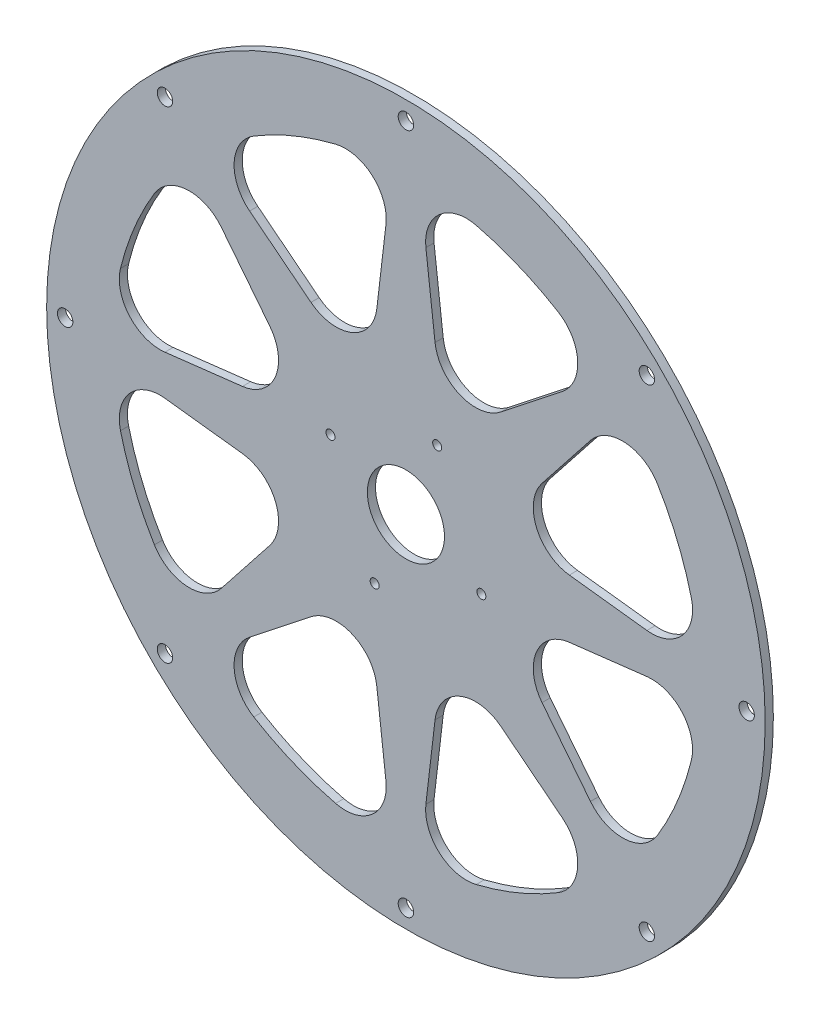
ISO-10303-21;
HEADER;
FILE_DESCRIPTION(('STEP AP214'),'2;1');
FILE_NAME('part.step','',(''),(''),'','','');
FILE_SCHEMA(('AUTOMOTIVE_DESIGN { 1 0 10303 214 1 1 1 1 }'));
ENDSEC;
DATA;
#1=APPLICATION_CONTEXT('core data for automotive mechanical design processes');
#2=APPLICATION_PROTOCOL_DEFINITION('international standard','automotive_design',2000,#1);
#3=PRODUCT_CONTEXT('',#1,'mechanical');
#4=PRODUCT('Part','Part','',(#3));
#5=PRODUCT_RELATED_PRODUCT_CATEGORY('part','',(#4));
#6=PRODUCT_DEFINITION_FORMATION('','',#4);
#7=PRODUCT_DEFINITION_CONTEXT('part definition',#1,'design');
#8=PRODUCT_DEFINITION('design','',#6,#7);
#9=PRODUCT_DEFINITION_SHAPE('','',#8);
#10=(LENGTH_UNIT() NAMED_UNIT(*) SI_UNIT(.MILLI.,.METRE.));
#11=(NAMED_UNIT(*) PLANE_ANGLE_UNIT() SI_UNIT($,.RADIAN.));
#12=(NAMED_UNIT(*) SI_UNIT($,.STERADIAN.) SOLID_ANGLE_UNIT());
#13=UNCERTAINTY_MEASURE_WITH_UNIT(LENGTH_MEASURE(1.E-05),#10,'distance_accuracy_value','');
#14=(GEOMETRIC_REPRESENTATION_CONTEXT(3) GLOBAL_UNCERTAINTY_ASSIGNED_CONTEXT((#13)) GLOBAL_UNIT_ASSIGNED_CONTEXT((#10,
#11,#12)) REPRESENTATION_CONTEXT('',''));
#15=CARTESIAN_POINT('',(0.,0.,0.));
#16=DIRECTION('',(0.,0.,1.));
#17=DIRECTION('',(1.,0.,0.));
#18=AXIS2_PLACEMENT_3D('',#15,#16,#17);
#19=CARTESIAN_POINT('',(0.,0.,6.35));
#20=DIRECTION('',(0.,0.,1.));
#21=DIRECTION('',(1.,0.,0.));
#22=AXIS2_PLACEMENT_3D('',#19,#20,#21);
#23=PLANE('',#22);
#24=CARTESIAN_POINT('',(358.666350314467,282.487426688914,6.35));
#25=DIRECTION('',(0.,0.,1.));
#26=DIRECTION('',(1.,0.,0.));
#27=AXIS2_PLACEMENT_3D('',#24,#25,#26);
#28=CIRCLE('',#27,3.50000000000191);
#29=CARTESIAN_POINT('',(362.166350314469,282.487426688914,6.35));
#30=VERTEX_POINT('',#29);
#31=EDGE_CURVE('E723',#30,#30,#28,.T.);
#32=ORIENTED_EDGE('',*,*,#31,.F.);
#33=EDGE_LOOP('',(#32));
#34=FACE_BOUND('',#33,.T.);
#35=CARTESIAN_POINT('',(275.699602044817,248.12147432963,6.35));
#36=DIRECTION('',(0.,0.,1.));
#37=DIRECTION('',(1.,0.,0.));
#38=AXIS2_PLACEMENT_3D('',#35,#36,#37);
#39=CIRCLE('',#38,3.50000000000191);
#40=CARTESIAN_POINT('',(279.199602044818,248.12147432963,6.35));
#41=VERTEX_POINT('',#40);
#42=EDGE_CURVE('E729',#41,#41,#39,.T.);
#43=ORIENTED_EDGE('',*,*,#42,.F.);
#44=EDGE_LOOP('',(#43));
#45=FACE_BOUND('',#44,.T.);
#46=CARTESIAN_POINT('',(241.333649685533,331.088222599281,6.35));
#47=DIRECTION('',(0.,0.,1.));
#48=DIRECTION('',(1.,0.,0.));
#49=AXIS2_PLACEMENT_3D('',#46,#47,#48);
#50=CIRCLE('',#49,3.5000000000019);
#51=CARTESIAN_POINT('',(244.833649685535,331.088222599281,6.35));
#52=VERTEX_POINT('',#51);
#53=EDGE_CURVE('E735',#52,#52,#50,.T.);
#54=ORIENTED_EDGE('',*,*,#53,.F.);
#55=EDGE_LOOP('',(#54));
#56=FACE_BOUND('',#55,.T.);
#57=CARTESIAN_POINT('',(324.300397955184,365.454174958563,6.35));
#58=DIRECTION('',(0.,0.,1.));
#59=DIRECTION('',(1.,0.,0.));
#60=AXIS2_PLACEMENT_3D('',#57,#58,#59);
#61=CIRCLE('',#60,3.50000000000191);
#62=CARTESIAN_POINT('',(327.800397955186,365.454174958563,6.35));
#63=VERTEX_POINT('',#62);
#64=EDGE_CURVE('E715',#63,#63,#61,.T.);
#65=ORIENTED_EDGE('',*,*,#64,.F.);
#66=EDGE_LOOP('',(#65));
#67=FACE_BOUND('',#66,.T.);
#68=CARTESIAN_POINT('',(299.999999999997,571.787824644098,6.35));
#69=DIRECTION('',(0.,0.,1.));
#70=DIRECTION('',(1.,0.,0.));
#71=AXIS2_PLACEMENT_3D('',#68,#69,#70);
#72=CIRCLE('',#71,6.00000000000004);
#73=CARTESIAN_POINT('',(305.999999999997,571.787824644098,6.35));
#74=VERTEX_POINT('',#73);
#75=EDGE_CURVE('E743',#74,#74,#72,.T.);
#76=ORIENTED_EDGE('',*,*,#75,.F.);
#77=EDGE_LOOP('',(#76));
#78=FACE_BOUND('',#77,.T.);
#79=CARTESIAN_POINT('',(112.616702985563,494.171121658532,6.35));
#80=DIRECTION('',(0.,0.,1.));
#81=DIRECTION('',(1.,0.,0.));
#82=AXIS2_PLACEMENT_3D('',#79,#80,#81);
#83=CIRCLE('',#82,6.00000000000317);
#84=CARTESIAN_POINT('',(118.616702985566,494.171121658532,6.35));
#85=VERTEX_POINT('',#84);
#86=EDGE_CURVE('E746',#85,#85,#83,.T.);
#87=ORIENTED_EDGE('',*,*,#86,.F.);
#88=EDGE_LOOP('',(#87));
#89=FACE_BOUND('',#88,.T.);
#90=CARTESIAN_POINT('',(35.,306.787824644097,6.35));
#91=DIRECTION('',(0.,0.,1.));
#92=DIRECTION('',(1.,0.,0.));
#93=AXIS2_PLACEMENT_3D('',#90,#91,#92);
#94=CIRCLE('',#93,5.99999999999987);
#95=CARTESIAN_POINT('',(40.9999999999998,306.787824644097,6.35));
#96=VERTEX_POINT('',#95);
#97=EDGE_CURVE('E749',#96,#96,#94,.T.);
#98=ORIENTED_EDGE('',*,*,#97,.F.);
#99=EDGE_LOOP('',(#98));
#100=FACE_BOUND('',#99,.T.);
#101=CARTESIAN_POINT('',(112.616702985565,119.404527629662,6.35));
#102=DIRECTION('',(0.,0.,1.));
#103=DIRECTION('',(1.,0.,0.));
#104=AXIS2_PLACEMENT_3D('',#101,#102,#103);
#105=CIRCLE('',#104,5.99999999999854);
#106=CARTESIAN_POINT('',(118.616702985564,119.404527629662,6.35));
#107=VERTEX_POINT('',#106);
#108=EDGE_CURVE('E752',#107,#107,#105,.T.);
#109=ORIENTED_EDGE('',*,*,#108,.F.);
#110=EDGE_LOOP('',(#109));
#111=FACE_BOUND('',#110,.T.);
#112=CARTESIAN_POINT('',(300.000000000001,41.7878246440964,6.35));
#113=DIRECTION('',(0.,0.,1.));
#114=DIRECTION('',(1.,0.,0.));
#115=AXIS2_PLACEMENT_3D('',#112,#113,#114);
#116=CIRCLE('',#115,6.00000000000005);
#117=CARTESIAN_POINT('',(306.000000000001,41.7878246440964,6.35));
#118=VERTEX_POINT('',#117);
#119=EDGE_CURVE('E755',#118,#118,#116,.T.);
#120=ORIENTED_EDGE('',*,*,#119,.F.);
#121=EDGE_LOOP('',(#120));
#122=FACE_BOUND('',#121,.T.);
#123=CARTESIAN_POINT('',(487.383297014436,119.404527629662,6.35));
#124=DIRECTION('',(0.,0.,1.));
#125=DIRECTION('',(1.,0.,0.));
#126=AXIS2_PLACEMENT_3D('',#123,#124,#125);
#127=CIRCLE('',#126,5.99999999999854);
#128=CARTESIAN_POINT('',(493.383297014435,119.404527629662,6.35));
#129=VERTEX_POINT('',#128);
#130=EDGE_CURVE('E758',#129,#129,#127,.T.);
#131=ORIENTED_EDGE('',*,*,#130,.F.);
#132=EDGE_LOOP('',(#131));
#133=FACE_BOUND('',#132,.T.);
#134=CARTESIAN_POINT('',(565.,306.787824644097,6.35));
#135=DIRECTION('',(0.,0.,1.));
#136=DIRECTION('',(1.,0.,0.));
#137=AXIS2_PLACEMENT_3D('',#134,#135,#136);
#138=CIRCLE('',#137,5.99999999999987);
#139=CARTESIAN_POINT('',(571.,306.787824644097,6.35));
#140=VERTEX_POINT('',#139);
#141=EDGE_CURVE('E761',#140,#140,#138,.T.);
#142=ORIENTED_EDGE('',*,*,#141,.F.);
#143=EDGE_LOOP('',(#142));
#144=FACE_BOUND('',#143,.T.);
#145=CARTESIAN_POINT('',(487.383297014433,494.171121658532,6.35));
#146=DIRECTION('',(0.,0.,1.));
#147=DIRECTION('',(1.,0.,0.));
#148=AXIS2_PLACEMENT_3D('',#145,#146,#147);
#149=CIRCLE('',#148,5.99999999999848);
#150=CARTESIAN_POINT('',(493.383297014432,494.171121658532,6.35));
#151=VERTEX_POINT('',#150);
#152=EDGE_CURVE('E764',#151,#151,#149,.T.);
#153=ORIENTED_EDGE('',*,*,#152,.F.);
#154=EDGE_LOOP('',(#153));
#155=FACE_BOUND('',#154,.T.);
#156=CARTESIAN_POINT('',(300.,306.787824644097,6.35));
#157=DIRECTION('',(0.,0.,1.));
#158=DIRECTION('',(1.,0.,0.));
#159=AXIS2_PLACEMENT_3D('',#156,#157,#158);
#160=CIRCLE('',#159,29.9999999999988);
#161=CARTESIAN_POINT('',(329.999999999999,306.787824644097,6.35));
#162=VERTEX_POINT('',#161);
#163=EDGE_CURVE('E378',#162,#162,#160,.T.);
#164=ORIENTED_EDGE('',*,*,#163,.F.);
#165=EDGE_LOOP('',(#164));
#166=FACE_BOUND('',#165,.T.);
#167=CARTESIAN_POINT('',(300.,306.787824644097,6.35));
#168=DIRECTION('',(0.,0.,1.));
#169=DIRECTION('',(1.,0.,0.));
#170=AXIS2_PLACEMENT_3D('',#167,#168,#169);
#171=CIRCLE('',#170,279.4);
#172=CARTESIAN_POINT('',(579.4,306.787824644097,6.35));
#173=VERTEX_POINT('',#172);
#174=EDGE_CURVE('E373',#173,#173,#171,.T.);
#175=ORIENTED_EDGE('',*,*,#174,.T.);
#176=EDGE_LOOP('',(#175));
#177=FACE_BOUND('',#176,.T.);
#178=CARTESIAN_POINT('',(300.,306.787824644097,6.35));
#179=DIRECTION('',(0.,0.,1.));
#180=DIRECTION('',(1.,0.,0.));
#181=AXIS2_PLACEMENT_3D('',#178,#179,#180);
#182=CIRCLE('',#181,228.6);
#183=CARTESIAN_POINT('',(181.687970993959,111.185616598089,6.35));
#184=VERTEX_POINT('',#183);
#185=CARTESIAN_POINT('',(245.347590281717,84.8169389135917,6.35));
#186=VERTEX_POINT('',#185);
#187=EDGE_CURVE('E369',#184,#186,#182,.T.);
#188=ORIENTED_EDGE('',*,*,#187,.F.);
#189=CARTESIAN_POINT('',(198.120197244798,138.352589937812,6.35));
#190=DIRECTION('',(0.,0.,1.));
#191=DIRECTION('',(1.,0.,0.));
#192=AXIS2_PLACEMENT_3D('',#189,#190,#191);
#193=CIRCLE('',#192,31.75);
#194=CARTESIAN_POINT('',(178.449570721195,163.275048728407,6.35));
#195=VERTEX_POINT('',#194);
#196=EDGE_CURVE('E396',#184,#195,#193,.F.);
#197=ORIENTED_EDGE('',*,*,#196,.T.);
#198=DIRECTION('',(0.784959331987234,0.619547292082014,0.));
#199=VECTOR('',#198,1.);
#200=CARTESIAN_POINT('',(-10.9079508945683,13.8202490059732,6.35));
#201=LINE('',#200,#199);
#202=CARTESIAN_POINT('',(226.158621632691,200.930519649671,6.35));
#203=VERTEX_POINT('',#202);
#204=EDGE_CURVE('E352',#195,#203,#201,.T.);
#205=ORIENTED_EDGE('',*,*,#204,.T.);
#206=CARTESIAN_POINT('',(245.829248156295,176.008060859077,6.35));
#207=DIRECTION('',(0.,0.,1.));
#208=DIRECTION('',(1.,0.,0.));
#209=AXIS2_PLACEMENT_3D('',#206,#207,#208);
#210=CIRCLE('',#209,31.75);
#211=CARTESIAN_POINT('',(277.361321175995,179.72166706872,6.35));
#212=VERTEX_POINT('',#211);
#213=EDGE_CURVE('E346',#203,#212,#210,.F.);
#214=ORIENTED_EDGE('',*,*,#213,.T.);
#215=DIRECTION('',(0.116963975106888,-0.993136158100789,0.));
#216=VECTOR('',#215,1.);
#217=CARTESIAN_POINT('',(294.443535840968,34.6773059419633,6.35));
#218=LINE('',#217,#216);
#219=CARTESIAN_POINT('',(284.47027576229,119.359834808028,6.35));
#220=VERTEX_POINT('',#219);
#221=EDGE_CURVE('E350',#212,#220,#218,.T.);
#222=ORIENTED_EDGE('',*,*,#221,.T.);
#223=CARTESIAN_POINT('',(252.93820274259,115.646228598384,6.35));
#224=DIRECTION('',(0.,0.,1.));
#225=DIRECTION('',(1.,0.,0.));
#226=AXIS2_PLACEMENT_3D('',#223,#224,#225);
#227=CIRCLE('',#226,31.75);
#228=EDGE_CURVE('E392',#220,#186,#227,.F.);
#229=ORIENTED_EDGE('',*,*,#228,.T.);
#230=EDGE_LOOP('',(#188,#197,#205,#214,#222,#229));
#231=FACE_BOUND('',#230,.T.);
#232=CARTESIAN_POINT('',(300.,306.787824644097,6.35));
#233=DIRECTION('',(0.,0.,1.));
#234=DIRECTION('',(0.707106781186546,0.707106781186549,0.));
#235=AXIS2_PLACEMENT_3D('',#232,#233,#234);
#236=CIRCLE('',#235,228.6);
#237=CARTESIAN_POINT('',(354.652409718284,84.8169389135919,6.35));
#238=VERTEX_POINT('',#237);
#239=CARTESIAN_POINT('',(418.312029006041,111.185616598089,6.35));
#240=VERTEX_POINT('',#239);
#241=EDGE_CURVE('E703',#238,#240,#236,.T.);
#242=ORIENTED_EDGE('',*,*,#241,.F.);
#243=CARTESIAN_POINT('',(347.061797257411,115.646228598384,6.35));
#244=DIRECTION('',(0.,0.,1.));
#245=DIRECTION('',(1.,0.,0.));
#246=AXIS2_PLACEMENT_3D('',#243,#244,#245);
#247=CIRCLE('',#246,31.75);
#248=CARTESIAN_POINT('',(315.529724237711,119.359834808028,6.35));
#249=VERTEX_POINT('',#248);
#250=EDGE_CURVE('E419',#238,#249,#247,.F.);
#251=ORIENTED_EDGE('',*,*,#250,.T.);
#252=DIRECTION('',(0.116963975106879,0.99313615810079,0.));
#253=VECTOR('',#252,1.);
#254=CARTESIAN_POINT('',(287.314238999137,-120.216655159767,6.35));
#255=LINE('',#254,#253);
#256=CARTESIAN_POINT('',(322.638678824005,179.72166706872,6.35));
#257=VERTEX_POINT('',#256);
#258=EDGE_CURVE('E665',#249,#257,#255,.T.);
#259=ORIENTED_EDGE('',*,*,#258,.T.);
#260=CARTESIAN_POINT('',(354.170751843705,176.008060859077,6.35));
#261=DIRECTION('',(0.,0.,1.));
#262=DIRECTION('',(1.,0.,0.));
#263=AXIS2_PLACEMENT_3D('',#260,#261,#262);
#264=CIRCLE('',#263,31.75);
#265=CARTESIAN_POINT('',(373.841378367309,200.930519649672,6.35));
#266=VERTEX_POINT('',#265);
#267=EDGE_CURVE('E423',#257,#266,#264,.F.);
#268=ORIENTED_EDGE('',*,*,#267,.T.);
#269=DIRECTION('',(0.784959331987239,-0.619547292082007,0.));
#270=VECTOR('',#269,1.);
#271=CARTESIAN_POINT('',(488.482179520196,110.447618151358,6.35));
#272=LINE('',#271,#270);
#273=CARTESIAN_POINT('',(421.550429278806,163.275048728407,6.35));
#274=VERTEX_POINT('',#273);
#275=EDGE_CURVE('E695',#266,#274,#272,.T.);
#276=ORIENTED_EDGE('',*,*,#275,.T.);
#277=CARTESIAN_POINT('',(401.879802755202,138.352589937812,6.35));
#278=DIRECTION('',(0.,0.,1.));
#279=DIRECTION('',(1.,0.,0.));
#280=AXIS2_PLACEMENT_3D('',#277,#278,#279);
#281=CIRCLE('',#280,31.75);
#282=EDGE_CURVE('E415',#274,#240,#281,.F.);
#283=ORIENTED_EDGE('',*,*,#282,.T.);
#284=EDGE_LOOP('',(#242,#251,#259,#268,#276,#283));
#285=FACE_BOUND('',#284,.T.);
#286=CARTESIAN_POINT('',(300.,306.787824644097,6.35));
#287=DIRECTION('',(0.,0.,1.));
#288=DIRECTION('',(0.707106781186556,-0.707106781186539,0.));
#289=AXIS2_PLACEMENT_3D('',#286,#287,#288);
#290=CIRCLE('',#289,228.6);
#291=CARTESIAN_POINT('',(78.0291142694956,252.135414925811,6.35));
#292=VERTEX_POINT('',#291);
#293=CARTESIAN_POINT('',(104.397791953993,188.475795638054,6.35));
#294=VERTEX_POINT('',#293);
#295=EDGE_CURVE('E599',#292,#294,#290,.T.);
#296=ORIENTED_EDGE('',*,*,#295,.F.);
#297=CARTESIAN_POINT('',(108.858403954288,259.726027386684,6.35));
#298=DIRECTION('',(0.,0.,1.));
#299=DIRECTION('',(1.,0.,0.));
#300=AXIS2_PLACEMENT_3D('',#297,#298,#299);
#301=CIRCLE('',#300,31.75);
#302=CARTESIAN_POINT('',(112.572010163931,291.258100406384,6.35));
#303=VERTEX_POINT('',#302);
#304=EDGE_CURVE('E580',#292,#303,#301,.F.);
#305=ORIENTED_EDGE('',*,*,#304,.T.);
#306=DIRECTION('',(0.993136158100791,-0.116963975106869,0.));
#307=VECTOR('',#306,1.);
#308=CARTESIAN_POINT('',(-127.004479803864,319.473585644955,6.35));
#309=LINE('',#308,#307);
#310=CARTESIAN_POINT('',(172.933842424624,284.14914582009,6.35));
#311=VERTEX_POINT('',#310);
#312=EDGE_CURVE('E590',#303,#311,#309,.T.);
#313=ORIENTED_EDGE('',*,*,#312,.T.);
#314=CARTESIAN_POINT('',(169.22023621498,252.61707280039,6.35));
#315=DIRECTION('',(0.,0.,1.));
#316=DIRECTION('',(1.,0.,0.));
#317=AXIS2_PLACEMENT_3D('',#314,#315,#316);
#318=CIRCLE('',#317,31.75);
#319=CARTESIAN_POINT('',(194.142695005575,232.946446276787,6.35));
#320=VERTEX_POINT('',#319);
#321=EDGE_CURVE('E49',#311,#320,#318,.F.);
#322=ORIENTED_EDGE('',*,*,#321,.T.);
#323=DIRECTION('',(-0.619547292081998,-0.784959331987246,0.));
#324=VECTOR('',#323,1.);
#325=CARTESIAN_POINT('',(103.659793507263,118.305645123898,6.35));
#326=LINE('',#325,#324);
#327=CARTESIAN_POINT('',(156.487224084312,185.237395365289,6.35));
#328=VERTEX_POINT('',#327);
#329=EDGE_CURVE('E589',#320,#328,#326,.T.);
#330=ORIENTED_EDGE('',*,*,#329,.T.);
#331=CARTESIAN_POINT('',(131.564765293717,204.908021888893,6.35));
#332=DIRECTION('',(0.,0.,1.));
#333=DIRECTION('',(1.,0.,0.));
#334=AXIS2_PLACEMENT_3D('',#331,#332,#333);
#335=CIRCLE('',#334,31.75);
#336=EDGE_CURVE('E576',#328,#294,#335,.F.);
#337=ORIENTED_EDGE('',*,*,#336,.T.);
#338=EDGE_LOOP('',(#296,#305,#313,#322,#330,#337));
#339=FACE_BOUND('',#338,.T.);
#340=CARTESIAN_POINT('',(300.,306.787824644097,6.35));
#341=DIRECTION('',(0.,0.,1.));
#342=DIRECTION('',(0.,-1.,0.));
#343=AXIS2_PLACEMENT_3D('',#340,#341,#342);
#344=CIRCLE('',#343,228.6);
#345=CARTESIAN_POINT('',(104.39779195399,425.099853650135,6.35));
#346=VERTEX_POINT('',#345);
#347=CARTESIAN_POINT('',(78.0291142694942,361.440234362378,6.35));
#348=VERTEX_POINT('',#347);
#349=EDGE_CURVE('E1557',#346,#348,#344,.T.);
#350=ORIENTED_EDGE('',*,*,#349,.F.);
#351=CARTESIAN_POINT('',(131.564765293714,408.667627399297,6.35));
#352=DIRECTION('',(0.,0.,1.));
#353=DIRECTION('',(1.,0.,0.));
#354=AXIS2_PLACEMENT_3D('',#351,#352,#353);
#355=CIRCLE('',#354,31.75);
#356=CARTESIAN_POINT('',(156.487224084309,428.338253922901,6.35));
#357=VERTEX_POINT('',#356);
#358=EDGE_CURVE('E554',#346,#357,#355,.F.);
#359=ORIENTED_EDGE('',*,*,#358,.T.);
#360=DIRECTION('',(0.619547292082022,-0.784959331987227,0.));
#361=VECTOR('',#360,1.);
#362=CARTESIAN_POINT('',(7.032424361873,617.695775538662,6.35));
#363=LINE('',#362,#361);
#364=CARTESIAN_POINT('',(194.142695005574,380.629203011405,6.35));
#365=VERTEX_POINT('',#364);
#366=EDGE_CURVE('E613',#357,#365,#363,.T.);
#367=ORIENTED_EDGE('',*,*,#366,.T.);
#368=CARTESIAN_POINT('',(169.220236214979,360.958576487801,6.35));
#369=DIRECTION('',(0.,0.,1.));
#370=DIRECTION('',(1.,0.,0.));
#371=AXIS2_PLACEMENT_3D('',#368,#369,#370);
#372=CIRCLE('',#371,31.75);
#373=CARTESIAN_POINT('',(172.933842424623,329.426503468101,6.35));
#374=VERTEX_POINT('',#373);
#375=EDGE_CURVE('E558',#365,#374,#372,.F.);
#376=ORIENTED_EDGE('',*,*,#375,.T.);
#377=DIRECTION('',(-0.993136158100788,-0.116963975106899,0.));
#378=VECTOR('',#377,1.);
#379=CARTESIAN_POINT('',(27.8894812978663,312.344288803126,6.35));
#380=LINE('',#379,#378);
#381=CARTESIAN_POINT('',(112.572010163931,322.317548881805,6.35));
#382=VERTEX_POINT('',#381);
#383=EDGE_CURVE('E609',#374,#382,#380,.T.);
#384=ORIENTED_EDGE('',*,*,#383,.T.);
#385=CARTESIAN_POINT('',(108.858403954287,353.849621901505,6.35));
#386=DIRECTION('',(0.,0.,1.));
#387=DIRECTION('',(1.,0.,0.));
#388=AXIS2_PLACEMENT_3D('',#385,#386,#387);
#389=CIRCLE('',#388,31.75);
#390=EDGE_CURVE('E550',#382,#348,#389,.F.);
#391=ORIENTED_EDGE('',*,*,#390,.T.);
#392=EDGE_LOOP('',(#350,#359,#367,#376,#384,#391));
#393=FACE_BOUND('',#392,.T.);
#394=CARTESIAN_POINT('',(300.,306.787824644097,6.35));
#395=DIRECTION('',(0.,0.,1.));
#396=DIRECTION('',(0.,1.,0.));
#397=AXIS2_PLACEMENT_3D('',#394,#395,#396);
#398=CIRCLE('',#397,228.6);
#399=CARTESIAN_POINT('',(495.602208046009,188.475795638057,6.35));
#400=VERTEX_POINT('',#399);
#401=CARTESIAN_POINT('',(521.970885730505,252.135414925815,6.35));
#402=VERTEX_POINT('',#401);
#403=EDGE_CURVE('E669',#400,#402,#398,.T.);
#404=ORIENTED_EDGE('',*,*,#403,.F.);
#405=CARTESIAN_POINT('',(468.435234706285,204.908021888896,6.35));
#406=DIRECTION('',(0.,0.,1.));
#407=DIRECTION('',(1.,0.,0.));
#408=AXIS2_PLACEMENT_3D('',#405,#406,#407);
#409=CIRCLE('',#408,31.75);
#410=CARTESIAN_POINT('',(443.512775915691,185.237395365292,6.35));
#411=VERTEX_POINT('',#410);
#412=EDGE_CURVE('E446',#400,#411,#409,.F.);
#413=ORIENTED_EDGE('',*,*,#412,.T.);
#414=DIRECTION('',(-0.619547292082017,0.784959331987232,0.));
#415=VECTOR('',#414,1.);
#416=CARTESIAN_POINT('',(592.967575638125,-4.12012625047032,6.35));
#417=LINE('',#416,#415);
#418=CARTESIAN_POINT('',(405.857304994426,232.946446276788,6.35));
#419=VERTEX_POINT('',#418);
#420=EDGE_CURVE('E666',#411,#419,#417,.T.);
#421=ORIENTED_EDGE('',*,*,#420,.T.);
#422=CARTESIAN_POINT('',(430.77976378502,252.617072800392,6.35));
#423=DIRECTION('',(0.,0.,1.));
#424=DIRECTION('',(1.,0.,0.));
#425=AXIS2_PLACEMENT_3D('',#422,#423,#424);
#426=CIRCLE('',#425,31.75);
#427=CARTESIAN_POINT('',(427.066157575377,284.149145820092,6.35));
#428=VERTEX_POINT('',#427);
#429=EDGE_CURVE('E450',#419,#428,#426,.F.);
#430=ORIENTED_EDGE('',*,*,#429,.T.);
#431=DIRECTION('',(0.993136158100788,0.116963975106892,0.));
#432=VECTOR('',#431,1.);
#433=CARTESIAN_POINT('',(572.110518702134,301.231360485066,6.35));
#434=LINE('',#433,#432);
#435=CARTESIAN_POINT('',(487.427989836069,291.258100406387,6.35));
#436=VERTEX_POINT('',#435);
#437=EDGE_CURVE('E659',#428,#436,#434,.T.);
#438=ORIENTED_EDGE('',*,*,#437,.T.);
#439=CARTESIAN_POINT('',(491.141596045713,259.726027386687,6.35));
#440=DIRECTION('',(0.,0.,1.));
#441=DIRECTION('',(1.,0.,0.));
#442=AXIS2_PLACEMENT_3D('',#439,#440,#441);
#443=CIRCLE('',#442,31.75);
#444=EDGE_CURVE('E442',#436,#402,#443,.F.);
#445=ORIENTED_EDGE('',*,*,#444,.T.);
#446=EDGE_LOOP('',(#404,#413,#421,#430,#438,#445));
#447=FACE_BOUND('',#446,.T.);
#448=CARTESIAN_POINT('',(300.,306.787824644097,6.35));
#449=DIRECTION('',(0.,0.,1.));
#450=DIRECTION('',(-0.707106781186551,0.707106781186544,0.));
#451=AXIS2_PLACEMENT_3D('',#448,#449,#450);
#452=CIRCLE('',#451,228.6);
#453=CARTESIAN_POINT('',(521.970885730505,361.440234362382,6.35));
#454=VERTEX_POINT('',#453);
#455=CARTESIAN_POINT('',(495.602208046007,425.099853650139,6.35));
#456=VERTEX_POINT('',#455);
#457=EDGE_CURVE('E686',#454,#456,#452,.T.);
#458=ORIENTED_EDGE('',*,*,#457,.F.);
#459=CARTESIAN_POINT('',(491.141596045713,353.849621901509,6.35));
#460=DIRECTION('',(0.,0.,1.));
#461=DIRECTION('',(1.,0.,0.));
#462=AXIS2_PLACEMENT_3D('',#459,#460,#461);
#463=CIRCLE('',#462,31.75);
#464=CARTESIAN_POINT('',(487.427989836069,322.317548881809,6.35));
#465=VERTEX_POINT('',#464);
#466=EDGE_CURVE('E473',#454,#465,#463,.F.);
#467=ORIENTED_EDGE('',*,*,#466,.T.);
#468=DIRECTION('',(-0.993136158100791,0.116963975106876,0.));
#469=VECTOR('',#468,1.);
#470=CARTESIAN_POINT('',(727.004479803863,294.102063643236,6.35));
#471=LINE('',#470,#469);
#472=CARTESIAN_POINT('',(427.066157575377,329.426503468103,6.35));
#473=VERTEX_POINT('',#472);
#474=EDGE_CURVE('E627',#465,#473,#471,.T.);
#475=ORIENTED_EDGE('',*,*,#474,.T.);
#476=CARTESIAN_POINT('',(430.77976378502,360.958576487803,6.35));
#477=DIRECTION('',(0.,0.,1.));
#478=DIRECTION('',(1.,0.,0.));
#479=AXIS2_PLACEMENT_3D('',#476,#477,#478);
#480=CIRCLE('',#479,31.75);
#481=CARTESIAN_POINT('',(405.857304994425,380.629203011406,6.35));
#482=VERTEX_POINT('',#481);
#483=EDGE_CURVE('E477',#473,#482,#480,.F.);
#484=ORIENTED_EDGE('',*,*,#483,.T.);
#485=DIRECTION('',(0.619547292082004,0.784959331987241,0.));
#486=VECTOR('',#485,1.);
#487=CARTESIAN_POINT('',(496.340206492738,495.270004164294,6.35));
#488=LINE('',#487,#486);
#489=CARTESIAN_POINT('',(443.512775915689,428.338253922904,6.35));
#490=VERTEX_POINT('',#489);
#491=EDGE_CURVE('E679',#482,#490,#488,.T.);
#492=ORIENTED_EDGE('',*,*,#491,.T.);
#493=CARTESIAN_POINT('',(468.435234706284,408.6676273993,6.35));
#494=DIRECTION('',(0.,0.,1.));
#495=DIRECTION('',(1.,0.,0.));
#496=AXIS2_PLACEMENT_3D('',#493,#494,#495);
#497=CIRCLE('',#496,31.75);
#498=EDGE_CURVE('E469',#490,#456,#497,.F.);
#499=ORIENTED_EDGE('',*,*,#498,.T.);
#500=EDGE_LOOP('',(#458,#467,#475,#484,#492,#499));
#501=FACE_BOUND('',#500,.T.);
#502=CARTESIAN_POINT('',(300.,306.787824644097,6.35));
#503=DIRECTION('',(0.,0.,1.));
#504=DIRECTION('',(-1.,0.,0.));
#505=AXIS2_PLACEMENT_3D('',#502,#503,#504);
#506=CIRCLE('',#505,228.6);
#507=CARTESIAN_POINT('',(418.312029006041,502.390032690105,6.35));
#508=VERTEX_POINT('',#507);
#509=CARTESIAN_POINT('',(354.652409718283,528.758710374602,6.35));
#510=VERTEX_POINT('',#509);
#511=EDGE_CURVE('E631',#508,#510,#506,.T.);
#512=ORIENTED_EDGE('',*,*,#511,.F.);
#513=CARTESIAN_POINT('',(401.879802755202,475.223059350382,6.35));
#514=DIRECTION('',(0.,0.,1.));
#515=DIRECTION('',(1.,0.,0.));
#516=AXIS2_PLACEMENT_3D('',#513,#514,#515);
#517=CIRCLE('',#516,31.75);
#518=CARTESIAN_POINT('',(421.550429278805,450.300600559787,6.35));
#519=VERTEX_POINT('',#518);
#520=EDGE_CURVE('E500',#508,#519,#517,.F.);
#521=ORIENTED_EDGE('',*,*,#520,.T.);
#522=DIRECTION('',(-0.784959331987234,-0.619547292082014,0.));
#523=VECTOR('',#522,1.);
#524=CARTESIAN_POINT('',(610.907950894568,599.755400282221,6.35));
#525=LINE('',#524,#523);
#526=CARTESIAN_POINT('',(373.841378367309,412.645129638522,6.35));
#527=VERTEX_POINT('',#526);
#528=EDGE_CURVE('E628',#519,#527,#525,.T.);
#529=ORIENTED_EDGE('',*,*,#528,.T.);
#530=CARTESIAN_POINT('',(354.170751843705,437.567588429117,6.35));
#531=DIRECTION('',(0.,0.,1.));
#532=DIRECTION('',(1.,0.,0.));
#533=AXIS2_PLACEMENT_3D('',#530,#531,#532);
#534=CIRCLE('',#533,31.75);
#535=CARTESIAN_POINT('',(322.638678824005,433.853982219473,6.35));
#536=VERTEX_POINT('',#535);
#537=EDGE_CURVE('E504',#527,#536,#534,.F.);
#538=ORIENTED_EDGE('',*,*,#537,.T.);
#539=DIRECTION('',(-0.116963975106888,0.993136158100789,0.));
#540=VECTOR('',#539,1.);
#541=CARTESIAN_POINT('',(305.556464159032,578.898343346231,6.35));
#542=LINE('',#541,#540);
#543=CARTESIAN_POINT('',(315.52972423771,494.215814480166,6.35));
#544=VERTEX_POINT('',#543);
#545=EDGE_CURVE('E621',#536,#544,#542,.T.);
#546=ORIENTED_EDGE('',*,*,#545,.T.);
#547=CARTESIAN_POINT('',(347.06179725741,497.92942068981,6.35));
#548=DIRECTION('',(0.,0.,1.));
#549=DIRECTION('',(1.,0.,0.));
#550=AXIS2_PLACEMENT_3D('',#547,#548,#549);
#551=CIRCLE('',#550,31.75);
#552=EDGE_CURVE('E496',#544,#510,#551,.F.);
#553=ORIENTED_EDGE('',*,*,#552,.T.);
#554=EDGE_LOOP('',(#512,#521,#529,#538,#546,#553));
#555=FACE_BOUND('',#554,.T.);
#556=CARTESIAN_POINT('',(300.,306.787824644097,6.35));
#557=DIRECTION('',(0.,0.,1.));
#558=DIRECTION('',(-0.707106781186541,-0.707106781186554,0.));
#559=AXIS2_PLACEMENT_3D('',#556,#557,#558);
#560=CIRCLE('',#559,228.6);
#561=CARTESIAN_POINT('',(245.347590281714,528.758710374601,6.35));
#562=VERTEX_POINT('',#561);
#563=CARTESIAN_POINT('',(181.687970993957,502.390032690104,6.35));
#564=VERTEX_POINT('',#563);
#565=EDGE_CURVE('E649',#562,#564,#560,.T.);
#566=ORIENTED_EDGE('',*,*,#565,.F.);
#567=CARTESIAN_POINT('',(252.938202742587,497.929420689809,6.35));
#568=DIRECTION('',(0.,0.,1.));
#569=DIRECTION('',(1.,0.,0.));
#570=AXIS2_PLACEMENT_3D('',#567,#568,#569);
#571=CIRCLE('',#570,31.75);
#572=CARTESIAN_POINT('',(284.470275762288,494.215814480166,6.35));
#573=VERTEX_POINT('',#572);
#574=EDGE_CURVE('E527',#562,#573,#571,.F.);
#575=ORIENTED_EDGE('',*,*,#574,.T.);
#576=DIRECTION('',(-0.116963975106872,-0.993136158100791,0.));
#577=VECTOR('',#576,1.);
#578=CARTESIAN_POINT('',(312.68576100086,733.79230444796,6.35));
#579=LINE('',#578,#577);
#580=CARTESIAN_POINT('',(277.361321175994,433.853982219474,6.35));
#581=VERTEX_POINT('',#580);
#582=EDGE_CURVE('E646',#573,#581,#579,.T.);
#583=ORIENTED_EDGE('',*,*,#582,.T.);
#584=CARTESIAN_POINT('',(245.829248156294,437.567588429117,6.35));
#585=DIRECTION('',(0.,0.,1.));
#586=DIRECTION('',(1.,0.,0.));
#587=AXIS2_PLACEMENT_3D('',#584,#585,#586);
#588=CIRCLE('',#587,31.75);
#589=CARTESIAN_POINT('',(226.15862163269,412.645129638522,6.35));
#590=VERTEX_POINT('',#589);
#591=EDGE_CURVE('E531',#581,#590,#588,.F.);
#592=ORIENTED_EDGE('',*,*,#591,.T.);
#593=DIRECTION('',(-0.784959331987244,0.619547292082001,0.));
#594=VECTOR('',#593,1.);
#595=CARTESIAN_POINT('',(111.517820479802,503.128031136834,6.35));
#596=LINE('',#595,#594);
#597=CARTESIAN_POINT('',(178.449570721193,450.300600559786,6.35));
#598=VERTEX_POINT('',#597);
#599=EDGE_CURVE('E641',#590,#598,#596,.T.);
#600=ORIENTED_EDGE('',*,*,#599,.T.);
#601=CARTESIAN_POINT('',(198.120197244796,475.223059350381,6.35));
#602=DIRECTION('',(0.,0.,1.));
#603=DIRECTION('',(1.,0.,0.));
#604=AXIS2_PLACEMENT_3D('',#601,#602,#603);
#605=CIRCLE('',#604,31.75);
#606=EDGE_CURVE('E523',#598,#564,#605,.F.);
#607=ORIENTED_EDGE('',*,*,#606,.T.);
#608=EDGE_LOOP('',(#566,#575,#583,#592,#600,#607));
#609=FACE_BOUND('',#608,.T.);
#610=ADVANCED_FACE('F41',(#34,#45,#56,#67,#78,#89,#100,#111,#122,#133,#144,#155,#166,#177,#231,
#285,#339,#393,#447,#501,#555,#609),#23,.T.);
#611=CARTESIAN_POINT('',(0.,0.,0.));
#612=DIRECTION('',(0.,0.,1.));
#613=DIRECTION('',(1.,0.,0.));
#614=AXIS2_PLACEMENT_3D('',#611,#612,#613);
#615=PLANE('',#614);
#616=DIRECTION('',(-0.784959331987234,-0.619547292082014,0.));
#617=VECTOR('',#616,1.);
#618=CARTESIAN_POINT('',(610.907950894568,599.755400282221,0.));
#619=LINE('',#618,#617);
#620=CARTESIAN_POINT('',(421.550429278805,450.300600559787,0.));
#621=VERTEX_POINT('',#620);
#622=CARTESIAN_POINT('',(373.841378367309,412.645129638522,0.));
#623=VERTEX_POINT('',#622);
#624=EDGE_CURVE('E617',#621,#623,#619,.T.);
#625=ORIENTED_EDGE('',*,*,#624,.F.);
#626=CARTESIAN_POINT('',(401.879802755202,475.223059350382,0.));
#627=DIRECTION('',(0.,0.,1.));
#628=DIRECTION('',(1.,0.,0.));
#629=AXIS2_PLACEMENT_3D('',#626,#627,#628);
#630=CIRCLE('',#629,31.75);
#631=CARTESIAN_POINT('',(418.312029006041,502.390032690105,0.));
#632=VERTEX_POINT('',#631);
#633=EDGE_CURVE('E502',#621,#632,#630,.T.);
#634=ORIENTED_EDGE('',*,*,#633,.T.);
#635=CARTESIAN_POINT('',(300.,306.787824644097,0.));
#636=DIRECTION('',(0.,0.,1.));
#637=DIRECTION('',(-1.,0.,0.));
#638=AXIS2_PLACEMENT_3D('',#635,#636,#637);
#639=CIRCLE('',#638,228.6);
#640=CARTESIAN_POINT('',(354.652409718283,528.758710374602,0.));
#641=VERTEX_POINT('',#640);
#642=EDGE_CURVE('E620',#632,#641,#639,.T.);
#643=ORIENTED_EDGE('',*,*,#642,.T.);
#644=CARTESIAN_POINT('',(347.06179725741,497.92942068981,0.));
#645=DIRECTION('',(0.,0.,1.));
#646=DIRECTION('',(1.,0.,0.));
#647=AXIS2_PLACEMENT_3D('',#644,#645,#646);
#648=CIRCLE('',#647,31.75);
#649=CARTESIAN_POINT('',(315.52972423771,494.215814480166,0.));
#650=VERTEX_POINT('',#649);
#651=EDGE_CURVE('E498',#641,#650,#648,.T.);
#652=ORIENTED_EDGE('',*,*,#651,.T.);
#653=DIRECTION('',(-0.116963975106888,0.993136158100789,0.));
#654=VECTOR('',#653,1.);
#655=CARTESIAN_POINT('',(305.556464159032,578.898343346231,0.));
#656=LINE('',#655,#654);
#657=CARTESIAN_POINT('',(322.638678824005,433.853982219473,0.));
#658=VERTEX_POINT('',#657);
#659=EDGE_CURVE('E624',#658,#650,#656,.T.);
#660=ORIENTED_EDGE('',*,*,#659,.F.);
#661=CARTESIAN_POINT('',(354.170751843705,437.567588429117,0.));
#662=DIRECTION('',(0.,0.,1.));
#663=DIRECTION('',(1.,0.,0.));
#664=AXIS2_PLACEMENT_3D('',#661,#662,#663);
#665=CIRCLE('',#664,31.75);
#666=EDGE_CURVE('E506',#658,#623,#665,.T.);
#667=ORIENTED_EDGE('',*,*,#666,.T.);
#668=EDGE_LOOP('',(#625,#634,#643,#652,#660,#667));
#669=FACE_BOUND('',#668,.T.);
#670=DIRECTION('',(-0.619547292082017,0.784959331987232,0.));
#671=VECTOR('',#670,1.);
#672=CARTESIAN_POINT('',(592.967575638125,-4.12012625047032,0.));
#673=LINE('',#672,#671);
#674=CARTESIAN_POINT('',(443.512775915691,185.237395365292,0.));
#675=VERTEX_POINT('',#674);
#676=CARTESIAN_POINT('',(405.857304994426,232.946446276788,0.));
#677=VERTEX_POINT('',#676);
#678=EDGE_CURVE('E655',#675,#677,#673,.T.);
#679=ORIENTED_EDGE('',*,*,#678,.F.);
#680=CARTESIAN_POINT('',(468.435234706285,204.908021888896,0.));
#681=DIRECTION('',(0.,0.,1.));
#682=DIRECTION('',(1.,0.,0.));
#683=AXIS2_PLACEMENT_3D('',#680,#681,#682);
#684=CIRCLE('',#683,31.75);
#685=CARTESIAN_POINT('',(495.602208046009,188.475795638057,0.));
#686=VERTEX_POINT('',#685);
#687=EDGE_CURVE('E448',#675,#686,#684,.T.);
#688=ORIENTED_EDGE('',*,*,#687,.T.);
#689=CARTESIAN_POINT('',(300.,306.787824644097,0.));
#690=DIRECTION('',(0.,0.,1.));
#691=DIRECTION('',(0.,1.,0.));
#692=AXIS2_PLACEMENT_3D('',#689,#690,#691);
#693=CIRCLE('',#692,228.6);
#694=CARTESIAN_POINT('',(521.970885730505,252.135414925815,0.));
#695=VERTEX_POINT('',#694);
#696=EDGE_CURVE('E658',#686,#695,#693,.T.);
#697=ORIENTED_EDGE('',*,*,#696,.T.);
#698=CARTESIAN_POINT('',(491.141596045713,259.726027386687,0.));
#699=DIRECTION('',(0.,0.,1.));
#700=DIRECTION('',(1.,0.,0.));
#701=AXIS2_PLACEMENT_3D('',#698,#699,#700);
#702=CIRCLE('',#701,31.75);
#703=CARTESIAN_POINT('',(487.427989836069,291.258100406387,0.));
#704=VERTEX_POINT('',#703);
#705=EDGE_CURVE('E444',#695,#704,#702,.T.);
#706=ORIENTED_EDGE('',*,*,#705,.T.);
#707=DIRECTION('',(0.993136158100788,0.116963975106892,0.));
#708=VECTOR('',#707,1.);
#709=CARTESIAN_POINT('',(572.110518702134,301.231360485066,0.));
#710=LINE('',#709,#708);
#711=CARTESIAN_POINT('',(427.066157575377,284.149145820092,0.));
#712=VERTEX_POINT('',#711);
#713=EDGE_CURVE('E662',#712,#704,#710,.T.);
#714=ORIENTED_EDGE('',*,*,#713,.F.);
#715=CARTESIAN_POINT('',(430.77976378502,252.617072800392,0.));
#716=DIRECTION('',(0.,0.,1.));
#717=DIRECTION('',(1.,0.,0.));
#718=AXIS2_PLACEMENT_3D('',#715,#716,#717);
#719=CIRCLE('',#718,31.75);
#720=EDGE_CURVE('E452',#712,#677,#719,.T.);
#721=ORIENTED_EDGE('',*,*,#720,.T.);
#722=EDGE_LOOP('',(#679,#688,#697,#706,#714,#721));
#723=FACE_BOUND('',#722,.T.);
#724=DIRECTION('',(0.993136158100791,-0.116963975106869,0.));
#725=VECTOR('',#724,1.);
#726=CARTESIAN_POINT('',(-127.004479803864,319.473585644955,0.));
#727=LINE('',#726,#725);
#728=CARTESIAN_POINT('',(112.572010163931,291.258100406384,0.));
#729=VERTEX_POINT('',#728);
#730=CARTESIAN_POINT('',(172.933842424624,284.14914582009,0.));
#731=VERTEX_POINT('',#730);
#732=EDGE_CURVE('E598',#729,#731,#727,.T.);
#733=ORIENTED_EDGE('',*,*,#732,.F.);
#734=CARTESIAN_POINT('',(108.858403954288,259.726027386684,0.));
#735=DIRECTION('',(0.,0.,1.));
#736=DIRECTION('',(1.,0.,0.));
#737=AXIS2_PLACEMENT_3D('',#734,#735,#736);
#738=CIRCLE('',#737,31.75);
#739=CARTESIAN_POINT('',(78.0291142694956,252.135414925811,0.));
#740=VERTEX_POINT('',#739);
#741=EDGE_CURVE('E582',#729,#740,#738,.T.);
#742=ORIENTED_EDGE('',*,*,#741,.T.);
#743=CARTESIAN_POINT('',(300.,306.787824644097,0.));
#744=DIRECTION('',(0.,0.,1.));
#745=DIRECTION('',(0.707106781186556,-0.707106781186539,0.));
#746=AXIS2_PLACEMENT_3D('',#743,#744,#745);
#747=CIRCLE('',#746,228.6);
#748=CARTESIAN_POINT('',(104.397791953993,188.475795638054,0.));
#749=VERTEX_POINT('',#748);
#750=EDGE_CURVE('E603',#740,#749,#747,.T.);
#751=ORIENTED_EDGE('',*,*,#750,.T.);
#752=CARTESIAN_POINT('',(131.564765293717,204.908021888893,0.));
#753=DIRECTION('',(0.,0.,1.));
#754=DIRECTION('',(1.,0.,0.));
#755=AXIS2_PLACEMENT_3D('',#752,#753,#754);
#756=CIRCLE('',#755,31.75);
#757=CARTESIAN_POINT('',(156.487224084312,185.237395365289,0.));
#758=VERTEX_POINT('',#757);
#759=EDGE_CURVE('E578',#749,#758,#756,.T.);
#760=ORIENTED_EDGE('',*,*,#759,.T.);
#761=DIRECTION('',(-0.619547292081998,-0.784959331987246,0.));
#762=VECTOR('',#761,1.);
#763=CARTESIAN_POINT('',(103.659793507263,118.305645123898,0.));
#764=LINE('',#763,#762);
#765=CARTESIAN_POINT('',(194.142695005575,232.946446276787,0.));
#766=VERTEX_POINT('',#765);
#767=EDGE_CURVE('E606',#766,#758,#764,.T.);
#768=ORIENTED_EDGE('',*,*,#767,.F.);
#769=CARTESIAN_POINT('',(169.22023621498,252.61707280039,0.));
#770=DIRECTION('',(0.,0.,1.));
#771=DIRECTION('',(1.,0.,0.));
#772=AXIS2_PLACEMENT_3D('',#769,#770,#771);
#773=CIRCLE('',#772,31.75);
#774=EDGE_CURVE('E11',#766,#731,#773,.T.);
#775=ORIENTED_EDGE('',*,*,#774,.T.);
#776=EDGE_LOOP('',(#733,#742,#751,#760,#768,#775));
#777=FACE_BOUND('',#776,.T.);
#778=DIRECTION('',(0.784959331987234,0.619547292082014,0.));
#779=VECTOR('',#778,1.);
#780=CARTESIAN_POINT('',(-10.9079508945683,13.8202490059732,0.));
#781=LINE('',#780,#779);
#782=CARTESIAN_POINT('',(178.449570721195,163.275048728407,0.));
#783=VERTEX_POINT('',#782);
#784=CARTESIAN_POINT('',(226.158621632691,200.930519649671,0.));
#785=VERTEX_POINT('',#784);
#786=EDGE_CURVE('E368',#783,#785,#781,.T.);
#787=ORIENTED_EDGE('',*,*,#786,.F.);
#788=CARTESIAN_POINT('',(198.120197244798,138.352589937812,0.));
#789=DIRECTION('',(0.,0.,1.));
#790=DIRECTION('',(1.,0.,0.));
#791=AXIS2_PLACEMENT_3D('',#788,#789,#790);
#792=CIRCLE('',#791,31.75);
#793=CARTESIAN_POINT('',(181.687970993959,111.185616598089,0.));
#794=VERTEX_POINT('',#793);
#795=EDGE_CURVE('E358',#783,#794,#792,.T.);
#796=ORIENTED_EDGE('',*,*,#795,.T.);
#797=CARTESIAN_POINT('',(300.,306.787824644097,0.));
#798=DIRECTION('',(0.,0.,1.));
#799=DIRECTION('',(1.,0.,0.));
#800=AXIS2_PLACEMENT_3D('',#797,#798,#799);
#801=CIRCLE('',#800,228.6);
#802=CARTESIAN_POINT('',(245.347590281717,84.8169389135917,0.));
#803=VERTEX_POINT('',#802);
#804=EDGE_CURVE('E710',#794,#803,#801,.T.);
#805=ORIENTED_EDGE('',*,*,#804,.T.);
#806=CARTESIAN_POINT('',(252.93820274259,115.646228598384,0.));
#807=DIRECTION('',(0.,0.,1.));
#808=DIRECTION('',(1.,0.,0.));
#809=AXIS2_PLACEMENT_3D('',#806,#807,#808);
#810=CIRCLE('',#809,31.75);
#811=CARTESIAN_POINT('',(284.47027576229,119.359834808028,0.));
#812=VERTEX_POINT('',#811);
#813=EDGE_CURVE('E394',#803,#812,#810,.T.);
#814=ORIENTED_EDGE('',*,*,#813,.T.);
#815=DIRECTION('',(0.116963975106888,-0.993136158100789,0.));
#816=VECTOR('',#815,1.);
#817=CARTESIAN_POINT('',(294.443535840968,34.6773059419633,0.));
#818=LINE('',#817,#816);
#819=CARTESIAN_POINT('',(277.361321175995,179.72166706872,0.));
#820=VERTEX_POINT('',#819);
#821=EDGE_CURVE('E713',#820,#812,#818,.T.);
#822=ORIENTED_EDGE('',*,*,#821,.F.);
#823=CARTESIAN_POINT('',(245.829248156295,176.008060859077,0.));
#824=DIRECTION('',(0.,0.,1.));
#825=DIRECTION('',(1.,0.,0.));
#826=AXIS2_PLACEMENT_3D('',#823,#824,#825);
#827=CIRCLE('',#826,31.75);
#828=EDGE_CURVE('E357',#820,#785,#827,.T.);
#829=ORIENTED_EDGE('',*,*,#828,.T.);
#830=EDGE_LOOP('',(#787,#796,#805,#814,#822,#829));
#831=FACE_BOUND('',#830,.T.);
#832=CARTESIAN_POINT('',(358.666350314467,282.487426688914,0.));
#833=DIRECTION('',(0.,0.,1.));
#834=DIRECTION('',(1.,0.,0.));
#835=AXIS2_PLACEMENT_3D('',#832,#833,#834);
#836=CIRCLE('',#835,3.50000000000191);
#837=CARTESIAN_POINT('',(362.166350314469,282.487426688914,0.));
#838=VERTEX_POINT('',#837);
#839=EDGE_CURVE('E719',#838,#838,#836,.T.);
#840=ORIENTED_EDGE('',*,*,#839,.T.);
#841=EDGE_LOOP('',(#840));
#842=FACE_BOUND('',#841,.T.);
#843=CARTESIAN_POINT('',(275.699602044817,248.12147432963,0.));
#844=DIRECTION('',(0.,0.,1.));
#845=DIRECTION('',(1.,0.,0.));
#846=AXIS2_PLACEMENT_3D('',#843,#844,#845);
#847=CIRCLE('',#846,3.50000000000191);
#848=CARTESIAN_POINT('',(279.199602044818,248.12147432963,0.));
#849=VERTEX_POINT('',#848);
#850=EDGE_CURVE('E726',#849,#849,#847,.T.);
#851=ORIENTED_EDGE('',*,*,#850,.T.);
#852=EDGE_LOOP('',(#851));
#853=FACE_BOUND('',#852,.T.);
#854=CARTESIAN_POINT('',(241.333649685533,331.088222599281,0.));
#855=DIRECTION('',(0.,0.,1.));
#856=DIRECTION('',(1.,0.,0.));
#857=AXIS2_PLACEMENT_3D('',#854,#855,#856);
#858=CIRCLE('',#857,3.5000000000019);
#859=CARTESIAN_POINT('',(244.833649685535,331.088222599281,0.));
#860=VERTEX_POINT('',#859);
#861=EDGE_CURVE('E732',#860,#860,#858,.T.);
#862=ORIENTED_EDGE('',*,*,#861,.T.);
#863=EDGE_LOOP('',(#862));
#864=FACE_BOUND('',#863,.T.);
#865=CARTESIAN_POINT('',(324.300397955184,365.454174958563,0.));
#866=DIRECTION('',(0.,0.,1.));
#867=DIRECTION('',(1.,0.,0.));
#868=AXIS2_PLACEMENT_3D('',#865,#866,#867);
#869=CIRCLE('',#868,3.50000000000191);
#870=CARTESIAN_POINT('',(327.800397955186,365.454174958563,0.));
#871=VERTEX_POINT('',#870);
#872=EDGE_CURVE('E738',#871,#871,#869,.T.);
#873=ORIENTED_EDGE('',*,*,#872,.T.);
#874=EDGE_LOOP('',(#873));
#875=FACE_BOUND('',#874,.T.);
#876=CARTESIAN_POINT('',(299.999999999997,571.787824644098,0.));
#877=DIRECTION('',(0.,0.,1.));
#878=DIRECTION('',(1.,0.,0.));
#879=AXIS2_PLACEMENT_3D('',#876,#877,#878);
#880=CIRCLE('',#879,6.00000000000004);
#881=CARTESIAN_POINT('',(305.999999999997,571.787824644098,0.));
#882=VERTEX_POINT('',#881);
#883=EDGE_CURVE('E722',#882,#882,#880,.T.);
#884=ORIENTED_EDGE('',*,*,#883,.T.);
#885=EDGE_LOOP('',(#884));
#886=FACE_BOUND('',#885,.T.);
#887=CARTESIAN_POINT('',(112.616702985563,494.171121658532,0.));
#888=DIRECTION('',(0.,0.,1.));
#889=DIRECTION('',(1.,0.,0.));
#890=AXIS2_PLACEMENT_3D('',#887,#888,#889);
#891=CIRCLE('',#890,6.00000000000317);
#892=CARTESIAN_POINT('',(118.616702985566,494.171121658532,0.));
#893=VERTEX_POINT('',#892);
#894=EDGE_CURVE('E771',#893,#893,#891,.T.);
#895=ORIENTED_EDGE('',*,*,#894,.T.);
#896=EDGE_LOOP('',(#895));
#897=FACE_BOUND('',#896,.T.);
#898=CARTESIAN_POINT('',(35.,306.787824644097,0.));
#899=DIRECTION('',(0.,0.,1.));
#900=DIRECTION('',(1.,0.,0.));
#901=AXIS2_PLACEMENT_3D('',#898,#899,#900);
#902=CIRCLE('',#901,5.99999999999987);
#903=CARTESIAN_POINT('',(40.9999999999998,306.787824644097,0.));
#904=VERTEX_POINT('',#903);
#905=EDGE_CURVE('E774',#904,#904,#902,.T.);
#906=ORIENTED_EDGE('',*,*,#905,.T.);
#907=EDGE_LOOP('',(#906));
#908=FACE_BOUND('',#907,.T.);
#909=CARTESIAN_POINT('',(112.616702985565,119.404527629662,0.));
#910=DIRECTION('',(0.,0.,1.));
#911=DIRECTION('',(1.,0.,0.));
#912=AXIS2_PLACEMENT_3D('',#909,#910,#911);
#913=CIRCLE('',#912,5.99999999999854);
#914=CARTESIAN_POINT('',(118.616702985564,119.404527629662,0.));
#915=VERTEX_POINT('',#914);
#916=EDGE_CURVE('E777',#915,#915,#913,.T.);
#917=ORIENTED_EDGE('',*,*,#916,.T.);
#918=EDGE_LOOP('',(#917));
#919=FACE_BOUND('',#918,.T.);
#920=CARTESIAN_POINT('',(300.000000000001,41.7878246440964,0.));
#921=DIRECTION('',(0.,0.,1.));
#922=DIRECTION('',(1.,0.,0.));
#923=AXIS2_PLACEMENT_3D('',#920,#921,#922);
#924=CIRCLE('',#923,6.00000000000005);
#925=CARTESIAN_POINT('',(306.000000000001,41.7878246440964,0.));
#926=VERTEX_POINT('',#925);
#927=EDGE_CURVE('E780',#926,#926,#924,.T.);
#928=ORIENTED_EDGE('',*,*,#927,.T.);
#929=EDGE_LOOP('',(#928));
#930=FACE_BOUND('',#929,.T.);
#931=CARTESIAN_POINT('',(487.383297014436,119.404527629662,0.));
#932=DIRECTION('',(0.,0.,1.));
#933=DIRECTION('',(1.,0.,0.));
#934=AXIS2_PLACEMENT_3D('',#931,#932,#933);
#935=CIRCLE('',#934,5.99999999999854);
#936=CARTESIAN_POINT('',(493.383297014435,119.404527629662,0.));
#937=VERTEX_POINT('',#936);
#938=EDGE_CURVE('E783',#937,#937,#935,.T.);
#939=ORIENTED_EDGE('',*,*,#938,.T.);
#940=EDGE_LOOP('',(#939));
#941=FACE_BOUND('',#940,.T.);
#942=CARTESIAN_POINT('',(565.,306.787824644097,0.));
#943=DIRECTION('',(0.,0.,1.));
#944=DIRECTION('',(1.,0.,0.));
#945=AXIS2_PLACEMENT_3D('',#942,#943,#944);
#946=CIRCLE('',#945,5.99999999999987);
#947=CARTESIAN_POINT('',(571.,306.787824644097,0.));
#948=VERTEX_POINT('',#947);
#949=EDGE_CURVE('E786',#948,#948,#946,.T.);
#950=ORIENTED_EDGE('',*,*,#949,.T.);
#951=EDGE_LOOP('',(#950));
#952=FACE_BOUND('',#951,.T.);
#953=CARTESIAN_POINT('',(487.383297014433,494.171121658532,0.));
#954=DIRECTION('',(0.,0.,1.));
#955=DIRECTION('',(1.,0.,0.));
#956=AXIS2_PLACEMENT_3D('',#953,#954,#955);
#957=CIRCLE('',#956,5.99999999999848);
#958=CARTESIAN_POINT('',(493.383297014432,494.171121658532,0.));
#959=VERTEX_POINT('',#958);
#960=EDGE_CURVE('E789',#959,#959,#957,.T.);
#961=ORIENTED_EDGE('',*,*,#960,.T.);
#962=EDGE_LOOP('',(#961));
#963=FACE_BOUND('',#962,.T.);
#964=CARTESIAN_POINT('',(300.,306.787824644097,0.));
#965=DIRECTION('',(0.,0.,1.));
#966=DIRECTION('',(1.,0.,0.));
#967=AXIS2_PLACEMENT_3D('',#964,#965,#966);
#968=CIRCLE('',#967,29.9999999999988);
#969=CARTESIAN_POINT('',(329.999999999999,306.787824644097,0.));
#970=VERTEX_POINT('',#969);
#971=EDGE_CURVE('E791',#970,#970,#968,.T.);
#972=ORIENTED_EDGE('',*,*,#971,.T.);
#973=EDGE_LOOP('',(#972));
#974=FACE_BOUND('',#973,.T.);
#975=CARTESIAN_POINT('',(300.,306.787824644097,0.));
#976=DIRECTION('',(0.,0.,1.));
#977=DIRECTION('',(1.,0.,0.));
#978=AXIS2_PLACEMENT_3D('',#975,#976,#977);
#979=CIRCLE('',#978,279.4);
#980=CARTESIAN_POINT('',(579.4,306.787824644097,0.));
#981=VERTEX_POINT('',#980);
#982=EDGE_CURVE('E381',#981,#981,#979,.T.);
#983=ORIENTED_EDGE('',*,*,#982,.F.);
#984=EDGE_LOOP('',(#983));
#985=FACE_BOUND('',#984,.T.);
#986=DIRECTION('',(0.116963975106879,0.99313615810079,0.));
#987=VECTOR('',#986,1.);
#988=CARTESIAN_POINT('',(287.314238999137,-120.216655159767,0.));
#989=LINE('',#988,#987);
#990=CARTESIAN_POINT('',(315.529724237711,119.359834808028,0.));
#991=VERTEX_POINT('',#990);
#992=CARTESIAN_POINT('',(322.638678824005,179.72166706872,0.));
#993=VERTEX_POINT('',#992);
#994=EDGE_CURVE('E691',#991,#993,#989,.T.);
#995=ORIENTED_EDGE('',*,*,#994,.F.);
#996=CARTESIAN_POINT('',(347.061797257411,115.646228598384,0.));
#997=DIRECTION('',(0.,0.,1.));
#998=DIRECTION('',(1.,0.,0.));
#999=AXIS2_PLACEMENT_3D('',#996,#997,#998);
#1000=CIRCLE('',#999,31.75);
#1001=CARTESIAN_POINT('',(354.652409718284,84.8169389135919,0.));
#1002=VERTEX_POINT('',#1001);
#1003=EDGE_CURVE('E421',#991,#1002,#1000,.T.);
#1004=ORIENTED_EDGE('',*,*,#1003,.T.);
#1005=CARTESIAN_POINT('',(300.,306.787824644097,0.));
#1006=DIRECTION('',(0.,0.,1.));
#1007=DIRECTION('',(0.707106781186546,0.707106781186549,0.));
#1008=AXIS2_PLACEMENT_3D('',#1005,#1006,#1007);
#1009=CIRCLE('',#1008,228.6);
#1010=CARTESIAN_POINT('',(418.312029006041,111.185616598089,0.));
#1011=VERTEX_POINT('',#1010);
#1012=EDGE_CURVE('E694',#1002,#1011,#1009,.T.);
#1013=ORIENTED_EDGE('',*,*,#1012,.T.);
#1014=CARTESIAN_POINT('',(401.879802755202,138.352589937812,0.));
#1015=DIRECTION('',(0.,0.,1.));
#1016=DIRECTION('',(1.,0.,0.));
#1017=AXIS2_PLACEMENT_3D('',#1014,#1015,#1016);
#1018=CIRCLE('',#1017,31.75);
#1019=CARTESIAN_POINT('',(421.550429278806,163.275048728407,0.));
#1020=VERTEX_POINT('',#1019);
#1021=EDGE_CURVE('E417',#1011,#1020,#1018,.T.);
#1022=ORIENTED_EDGE('',*,*,#1021,.T.);
#1023=DIRECTION('',(0.784959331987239,-0.619547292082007,0.));
#1024=VECTOR('',#1023,1.);
#1025=CARTESIAN_POINT('',(488.482179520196,110.447618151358,0.));
#1026=LINE('',#1025,#1024);
#1027=CARTESIAN_POINT('',(373.841378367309,200.930519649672,0.));
#1028=VERTEX_POINT('',#1027);
#1029=EDGE_CURVE('E698',#1028,#1020,#1026,.T.);
#1030=ORIENTED_EDGE('',*,*,#1029,.F.);
#1031=CARTESIAN_POINT('',(354.170751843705,176.008060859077,0.));
#1032=DIRECTION('',(0.,0.,1.));
#1033=DIRECTION('',(1.,0.,0.));
#1034=AXIS2_PLACEMENT_3D('',#1031,#1032,#1033);
#1035=CIRCLE('',#1034,31.75);
#1036=EDGE_CURVE('E425',#1028,#993,#1035,.T.);
#1037=ORIENTED_EDGE('',*,*,#1036,.T.);
#1038=EDGE_LOOP('',(#995,#1004,#1013,#1022,#1030,#1037));
#1039=FACE_BOUND('',#1038,.T.);
#1040=DIRECTION('',(0.619547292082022,-0.784959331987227,0.));
#1041=VECTOR('',#1040,1.);
#1042=CARTESIAN_POINT('',(7.032424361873,617.695775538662,0.));
#1043=LINE('',#1042,#1041);
#1044=CARTESIAN_POINT('',(156.487224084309,428.338253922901,0.));
#1045=VERTEX_POINT('',#1044);
#1046=CARTESIAN_POINT('',(194.142695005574,380.629203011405,0.));
#1047=VERTEX_POINT('',#1046);
#1048=EDGE_CURVE('E812',#1045,#1047,#1043,.T.);
#1049=ORIENTED_EDGE('',*,*,#1048,.F.);
#1050=CARTESIAN_POINT('',(131.564765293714,408.667627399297,0.));
#1051=DIRECTION('',(0.,0.,1.));
#1052=DIRECTION('',(1.,0.,0.));
#1053=AXIS2_PLACEMENT_3D('',#1050,#1051,#1052);
#1054=CIRCLE('',#1053,31.75);
#1055=CARTESIAN_POINT('',(104.39779195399,425.099853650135,0.));
#1056=VERTEX_POINT('',#1055);
#1057=EDGE_CURVE('E556',#1045,#1056,#1054,.T.);
#1058=ORIENTED_EDGE('',*,*,#1057,.T.);
#1059=CARTESIAN_POINT('',(300.,306.787824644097,0.));
#1060=DIRECTION('',(0.,0.,1.));
#1061=DIRECTION('',(0.,-1.,0.));
#1062=AXIS2_PLACEMENT_3D('',#1059,#1060,#1061);
#1063=CIRCLE('',#1062,228.6);
#1064=CARTESIAN_POINT('',(78.0291142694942,361.440234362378,0.));
#1065=VERTEX_POINT('',#1064);
#1066=EDGE_CURVE('E1550',#1056,#1065,#1063,.T.);
#1067=ORIENTED_EDGE('',*,*,#1066,.T.);
#1068=CARTESIAN_POINT('',(108.858403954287,353.849621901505,0.));
#1069=DIRECTION('',(0.,0.,1.));
#1070=DIRECTION('',(1.,0.,0.));
#1071=AXIS2_PLACEMENT_3D('',#1068,#1069,#1070);
#1072=CIRCLE('',#1071,31.75);
#1073=CARTESIAN_POINT('',(112.572010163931,322.317548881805,0.));
#1074=VERTEX_POINT('',#1073);
#1075=EDGE_CURVE('E552',#1065,#1074,#1072,.T.);
#1076=ORIENTED_EDGE('',*,*,#1075,.T.);
#1077=DIRECTION('',(-0.993136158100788,-0.116963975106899,0.));
#1078=VECTOR('',#1077,1.);
#1079=CARTESIAN_POINT('',(27.8894812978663,312.344288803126,0.));
#1080=LINE('',#1079,#1078);
#1081=CARTESIAN_POINT('',(172.933842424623,329.426503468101,0.));
#1082=VERTEX_POINT('',#1081);
#1083=EDGE_CURVE('E650',#1082,#1074,#1080,.T.);
#1084=ORIENTED_EDGE('',*,*,#1083,.F.);
#1085=CARTESIAN_POINT('',(169.220236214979,360.958576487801,0.));
#1086=DIRECTION('',(0.,0.,1.));
#1087=DIRECTION('',(1.,0.,0.));
#1088=AXIS2_PLACEMENT_3D('',#1085,#1086,#1087);
#1089=CIRCLE('',#1088,31.75);
#1090=EDGE_CURVE('E560',#1082,#1047,#1089,.T.);
#1091=ORIENTED_EDGE('',*,*,#1090,.T.);
#1092=EDGE_LOOP('',(#1049,#1058,#1067,#1076,#1084,#1091));
#1093=FACE_BOUND('',#1092,.T.);
#1094=DIRECTION('',(-0.993136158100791,0.116963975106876,0.));
#1095=VECTOR('',#1094,1.);
#1096=CARTESIAN_POINT('',(727.004479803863,294.102063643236,0.));
#1097=LINE('',#1096,#1095);
#1098=CARTESIAN_POINT('',(487.427989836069,322.317548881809,0.));
#1099=VERTEX_POINT('',#1098);
#1100=CARTESIAN_POINT('',(427.066157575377,329.426503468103,0.));
#1101=VERTEX_POINT('',#1100);
#1102=EDGE_CURVE('E675',#1099,#1101,#1097,.T.);
#1103=ORIENTED_EDGE('',*,*,#1102,.F.);
#1104=CARTESIAN_POINT('',(491.141596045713,353.849621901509,0.));
#1105=DIRECTION('',(0.,0.,1.));
#1106=DIRECTION('',(1.,0.,0.));
#1107=AXIS2_PLACEMENT_3D('',#1104,#1105,#1106);
#1108=CIRCLE('',#1107,31.75);
#1109=CARTESIAN_POINT('',(521.970885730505,361.440234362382,0.));
#1110=VERTEX_POINT('',#1109);
#1111=EDGE_CURVE('E475',#1099,#1110,#1108,.T.);
#1112=ORIENTED_EDGE('',*,*,#1111,.T.);
#1113=CARTESIAN_POINT('',(300.,306.787824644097,0.));
#1114=DIRECTION('',(0.,0.,1.));
#1115=DIRECTION('',(-0.707106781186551,0.707106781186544,0.));
#1116=AXIS2_PLACEMENT_3D('',#1113,#1114,#1115);
#1117=CIRCLE('',#1116,228.6);
#1118=CARTESIAN_POINT('',(495.602208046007,425.099853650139,0.));
#1119=VERTEX_POINT('',#1118);
#1120=EDGE_CURVE('E678',#1110,#1119,#1117,.T.);
#1121=ORIENTED_EDGE('',*,*,#1120,.T.);
#1122=CARTESIAN_POINT('',(468.435234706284,408.6676273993,0.));
#1123=DIRECTION('',(0.,0.,1.));
#1124=DIRECTION('',(1.,0.,0.));
#1125=AXIS2_PLACEMENT_3D('',#1122,#1123,#1124);
#1126=CIRCLE('',#1125,31.75);
#1127=CARTESIAN_POINT('',(443.512775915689,428.338253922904,0.));
#1128=VERTEX_POINT('',#1127);
#1129=EDGE_CURVE('E471',#1119,#1128,#1126,.T.);
#1130=ORIENTED_EDGE('',*,*,#1129,.T.);
#1131=DIRECTION('',(0.619547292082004,0.784959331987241,0.));
#1132=VECTOR('',#1131,1.);
#1133=CARTESIAN_POINT('',(496.340206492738,495.270004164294,0.));
#1134=LINE('',#1133,#1132);
#1135=CARTESIAN_POINT('',(405.857304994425,380.629203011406,0.));
#1136=VERTEX_POINT('',#1135);
#1137=EDGE_CURVE('E670',#1136,#1128,#1134,.T.);
#1138=ORIENTED_EDGE('',*,*,#1137,.F.);
#1139=CARTESIAN_POINT('',(430.77976378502,360.958576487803,0.));
#1140=DIRECTION('',(0.,0.,1.));
#1141=DIRECTION('',(1.,0.,0.));
#1142=AXIS2_PLACEMENT_3D('',#1139,#1140,#1141);
#1143=CIRCLE('',#1142,31.75);
#1144=EDGE_CURVE('E479',#1136,#1101,#1143,.T.);
#1145=ORIENTED_EDGE('',*,*,#1144,.T.);
#1146=EDGE_LOOP('',(#1103,#1112,#1121,#1130,#1138,#1145));
#1147=FACE_BOUND('',#1146,.T.);
#1148=DIRECTION('',(-0.116963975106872,-0.993136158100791,0.));
#1149=VECTOR('',#1148,1.);
#1150=CARTESIAN_POINT('',(312.68576100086,733.79230444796,0.));
#1151=LINE('',#1150,#1149);
#1152=CARTESIAN_POINT('',(284.470275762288,494.215814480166,0.));
#1153=VERTEX_POINT('',#1152);
#1154=CARTESIAN_POINT('',(277.361321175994,433.853982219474,0.));
#1155=VERTEX_POINT('',#1154);
#1156=EDGE_CURVE('E637',#1153,#1155,#1151,.T.);
#1157=ORIENTED_EDGE('',*,*,#1156,.F.);
#1158=CARTESIAN_POINT('',(252.938202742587,497.929420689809,0.));
#1159=DIRECTION('',(0.,0.,1.));
#1160=DIRECTION('',(1.,0.,0.));
#1161=AXIS2_PLACEMENT_3D('',#1158,#1159,#1160);
#1162=CIRCLE('',#1161,31.75);
#1163=CARTESIAN_POINT('',(245.347590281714,528.758710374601,0.));
#1164=VERTEX_POINT('',#1163);
#1165=EDGE_CURVE('E529',#1153,#1164,#1162,.T.);
#1166=ORIENTED_EDGE('',*,*,#1165,.T.);
#1167=CARTESIAN_POINT('',(300.,306.787824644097,0.));
#1168=DIRECTION('',(0.,0.,1.));
#1169=DIRECTION('',(-0.707106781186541,-0.707106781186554,0.));
#1170=AXIS2_PLACEMENT_3D('',#1167,#1168,#1169);
#1171=CIRCLE('',#1170,228.6);
#1172=CARTESIAN_POINT('',(181.687970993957,502.390032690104,0.));
#1173=VERTEX_POINT('',#1172);
#1174=EDGE_CURVE('E640',#1164,#1173,#1171,.T.);
#1175=ORIENTED_EDGE('',*,*,#1174,.T.);
#1176=CARTESIAN_POINT('',(198.120197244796,475.223059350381,0.));
#1177=DIRECTION('',(0.,0.,1.));
#1178=DIRECTION('',(1.,0.,0.));
#1179=AXIS2_PLACEMENT_3D('',#1176,#1177,#1178);
#1180=CIRCLE('',#1179,31.75);
#1181=CARTESIAN_POINT('',(178.449570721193,450.300600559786,0.));
#1182=VERTEX_POINT('',#1181);
#1183=EDGE_CURVE('E525',#1173,#1182,#1180,.T.);
#1184=ORIENTED_EDGE('',*,*,#1183,.T.);
#1185=DIRECTION('',(-0.784959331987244,0.619547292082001,0.));
#1186=VECTOR('',#1185,1.);
#1187=CARTESIAN_POINT('',(111.517820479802,503.128031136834,0.));
#1188=LINE('',#1187,#1186);
#1189=CARTESIAN_POINT('',(226.15862163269,412.645129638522,0.));
#1190=VERTEX_POINT('',#1189);
#1191=EDGE_CURVE('E632',#1190,#1182,#1188,.T.);
#1192=ORIENTED_EDGE('',*,*,#1191,.F.);
#1193=CARTESIAN_POINT('',(245.829248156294,437.567588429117,0.));
#1194=DIRECTION('',(0.,0.,1.));
#1195=DIRECTION('',(1.,0.,0.));
#1196=AXIS2_PLACEMENT_3D('',#1193,#1194,#1195);
#1197=CIRCLE('',#1196,31.75);
#1198=EDGE_CURVE('E533',#1190,#1155,#1197,.T.);
#1199=ORIENTED_EDGE('',*,*,#1198,.T.);
#1200=EDGE_LOOP('',(#1157,#1166,#1175,#1184,#1192,#1199));
#1201=FACE_BOUND('',#1200,.T.);
#1202=ADVANCED_FACE('F800',(#669,#723,#777,#831,#842,#853,#864,#875,#886,#897,#908,#919,#930,
#941,#952,#963,#974,#985,#1039,#1093,#1147,#1201),#615,.F.);
#1203=CARTESIAN_POINT('',(300.,306.787824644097,6.35));
#1204=DIRECTION('',(0.,0.,-1.));
#1205=DIRECTION('',(-1.,0.,0.));
#1206=AXIS2_PLACEMENT_3D('',#1203,#1204,#1205);
#1207=CYLINDRICAL_SURFACE('',#1206,29.9999999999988);
#1208=ORIENTED_EDGE('',*,*,#163,.T.);
#1209=EDGE_LOOP('',(#1208));
#1210=FACE_BOUND('',#1209,.T.);
#1211=ORIENTED_EDGE('',*,*,#971,.F.);
#1212=EDGE_LOOP('',(#1211));
#1213=FACE_BOUND('',#1212,.T.);
#1214=ADVANCED_FACE('F803',(#1210,#1213),#1207,.F.);
#1215=CARTESIAN_POINT('',(487.383297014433,494.171121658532,6.35));
#1216=DIRECTION('',(0.,0.,-1.));
#1217=DIRECTION('',(-1.,0.,0.));
#1218=AXIS2_PLACEMENT_3D('',#1215,#1216,#1217);
#1219=CYLINDRICAL_SURFACE('',#1218,5.99999999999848);
#1220=ORIENTED_EDGE('',*,*,#152,.T.);
#1221=EDGE_LOOP('',(#1220));
#1222=FACE_BOUND('',#1221,.T.);
#1223=ORIENTED_EDGE('',*,*,#960,.F.);
#1224=EDGE_LOOP('',(#1223));
#1225=FACE_BOUND('',#1224,.T.);
#1226=ADVANCED_FACE('F876',(#1222,#1225),#1219,.F.);
#1227=CARTESIAN_POINT('',(565.,306.787824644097,6.35));
#1228=DIRECTION('',(0.,0.,-1.));
#1229=DIRECTION('',(-1.,0.,0.));
#1230=AXIS2_PLACEMENT_3D('',#1227,#1228,#1229);
#1231=CYLINDRICAL_SURFACE('',#1230,5.99999999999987);
#1232=ORIENTED_EDGE('',*,*,#141,.T.);
#1233=EDGE_LOOP('',(#1232));
#1234=FACE_BOUND('',#1233,.T.);
#1235=ORIENTED_EDGE('',*,*,#949,.F.);
#1236=EDGE_LOOP('',(#1235));
#1237=FACE_BOUND('',#1236,.T.);
#1238=ADVANCED_FACE('F880',(#1234,#1237),#1231,.F.);
#1239=CARTESIAN_POINT('',(487.383297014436,119.404527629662,6.35));
#1240=DIRECTION('',(0.,0.,-1.));
#1241=DIRECTION('',(-1.,0.,0.));
#1242=AXIS2_PLACEMENT_3D('',#1239,#1240,#1241);
#1243=CYLINDRICAL_SURFACE('',#1242,5.99999999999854);
#1244=ORIENTED_EDGE('',*,*,#130,.T.);
#1245=EDGE_LOOP('',(#1244));
#1246=FACE_BOUND('',#1245,.T.);
#1247=ORIENTED_EDGE('',*,*,#938,.F.);
#1248=EDGE_LOOP('',(#1247));
#1249=FACE_BOUND('',#1248,.T.);
#1250=ADVANCED_FACE('F884',(#1246,#1249),#1243,.F.);
#1251=CARTESIAN_POINT('',(300.000000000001,41.7878246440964,6.35));
#1252=DIRECTION('',(0.,0.,-1.));
#1253=DIRECTION('',(-1.,0.,0.));
#1254=AXIS2_PLACEMENT_3D('',#1251,#1252,#1253);
#1255=CYLINDRICAL_SURFACE('',#1254,6.00000000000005);
#1256=ORIENTED_EDGE('',*,*,#119,.T.);
#1257=EDGE_LOOP('',(#1256));
#1258=FACE_BOUND('',#1257,.T.);
#1259=ORIENTED_EDGE('',*,*,#927,.F.);
#1260=EDGE_LOOP('',(#1259));
#1261=FACE_BOUND('',#1260,.T.);
#1262=ADVANCED_FACE('F888',(#1258,#1261),#1255,.F.);
#1263=CARTESIAN_POINT('',(112.616702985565,119.404527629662,6.35));
#1264=DIRECTION('',(0.,0.,-1.));
#1265=DIRECTION('',(-1.,0.,0.));
#1266=AXIS2_PLACEMENT_3D('',#1263,#1264,#1265);
#1267=CYLINDRICAL_SURFACE('',#1266,5.99999999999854);
#1268=ORIENTED_EDGE('',*,*,#108,.T.);
#1269=EDGE_LOOP('',(#1268));
#1270=FACE_BOUND('',#1269,.T.);
#1271=ORIENTED_EDGE('',*,*,#916,.F.);
#1272=EDGE_LOOP('',(#1271));
#1273=FACE_BOUND('',#1272,.T.);
#1274=ADVANCED_FACE('F892',(#1270,#1273),#1267,.F.);
#1275=CARTESIAN_POINT('',(35.,306.787824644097,6.35));
#1276=DIRECTION('',(0.,0.,-1.));
#1277=DIRECTION('',(-1.,0.,0.));
#1278=AXIS2_PLACEMENT_3D('',#1275,#1276,#1277);
#1279=CYLINDRICAL_SURFACE('',#1278,5.99999999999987);
#1280=ORIENTED_EDGE('',*,*,#97,.T.);
#1281=EDGE_LOOP('',(#1280));
#1282=FACE_BOUND('',#1281,.T.);
#1283=ORIENTED_EDGE('',*,*,#905,.F.);
#1284=EDGE_LOOP('',(#1283));
#1285=FACE_BOUND('',#1284,.T.);
#1286=ADVANCED_FACE('F896',(#1282,#1285),#1279,.F.);
#1287=CARTESIAN_POINT('',(112.616702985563,494.171121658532,6.35));
#1288=DIRECTION('',(0.,0.,-1.));
#1289=DIRECTION('',(-1.,0.,0.));
#1290=AXIS2_PLACEMENT_3D('',#1287,#1288,#1289);
#1291=CYLINDRICAL_SURFACE('',#1290,6.00000000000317);
#1292=ORIENTED_EDGE('',*,*,#86,.T.);
#1293=EDGE_LOOP('',(#1292));
#1294=FACE_BOUND('',#1293,.T.);
#1295=ORIENTED_EDGE('',*,*,#894,.F.);
#1296=EDGE_LOOP('',(#1295));
#1297=FACE_BOUND('',#1296,.T.);
#1298=ADVANCED_FACE('F900',(#1294,#1297),#1291,.F.);
#1299=CARTESIAN_POINT('',(299.999999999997,571.787824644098,6.35));
#1300=DIRECTION('',(0.,0.,-1.));
#1301=DIRECTION('',(-1.,0.,0.));
#1302=AXIS2_PLACEMENT_3D('',#1299,#1300,#1301);
#1303=CYLINDRICAL_SURFACE('',#1302,6.00000000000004);
#1304=ORIENTED_EDGE('',*,*,#75,.T.);
#1305=EDGE_LOOP('',(#1304));
#1306=FACE_BOUND('',#1305,.T.);
#1307=ORIENTED_EDGE('',*,*,#883,.F.);
#1308=EDGE_LOOP('',(#1307));
#1309=FACE_BOUND('',#1308,.T.);
#1310=ADVANCED_FACE('F872',(#1306,#1309),#1303,.F.);
#1311=CARTESIAN_POINT('',(300.,306.787824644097,6.35));
#1312=DIRECTION('',(0.,0.,-1.));
#1313=DIRECTION('',(-1.,0.,0.));
#1314=AXIS2_PLACEMENT_3D('',#1311,#1312,#1313);
#1315=CYLINDRICAL_SURFACE('',#1314,279.4);
#1316=ORIENTED_EDGE('',*,*,#174,.F.);
#1317=EDGE_LOOP('',(#1316));
#1318=FACE_BOUND('',#1317,.T.);
#1319=ORIENTED_EDGE('',*,*,#982,.T.);
#1320=EDGE_LOOP('',(#1319));
#1321=FACE_BOUND('',#1320,.T.);
#1322=ADVANCED_FACE('F798',(#1318,#1321),#1315,.T.);
#1323=CARTESIAN_POINT('',(324.300397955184,365.454174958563,0.));
#1324=DIRECTION('',(0.,0.,1.));
#1325=DIRECTION('',(1.,0.,0.));
#1326=AXIS2_PLACEMENT_3D('',#1323,#1324,#1325);
#1327=CYLINDRICAL_SURFACE('',#1326,3.50000000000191);
#1328=ORIENTED_EDGE('',*,*,#872,.F.);
#1329=EDGE_LOOP('',(#1328));
#1330=FACE_BOUND('',#1329,.T.);
#1331=ORIENTED_EDGE('',*,*,#64,.T.);
#1332=EDGE_LOOP('',(#1331));
#1333=FACE_BOUND('',#1332,.T.);
#1334=ADVANCED_FACE('F867',(#1330,#1333),#1327,.F.);
#1335=CARTESIAN_POINT('',(241.333649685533,331.088222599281,0.));
#1336=DIRECTION('',(0.,0.,1.));
#1337=DIRECTION('',(1.,0.,0.));
#1338=AXIS2_PLACEMENT_3D('',#1335,#1336,#1337);
#1339=CYLINDRICAL_SURFACE('',#1338,3.5000000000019);
#1340=ORIENTED_EDGE('',*,*,#861,.F.);
#1341=EDGE_LOOP('',(#1340));
#1342=FACE_BOUND('',#1341,.T.);
#1343=ORIENTED_EDGE('',*,*,#53,.T.);
#1344=EDGE_LOOP('',(#1343));
#1345=FACE_BOUND('',#1344,.T.);
#1346=ADVANCED_FACE('F1355',(#1342,#1345),#1339,.F.);
#1347=CARTESIAN_POINT('',(275.699602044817,248.12147432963,0.));
#1348=DIRECTION('',(0.,0.,1.));
#1349=DIRECTION('',(1.,0.,0.));
#1350=AXIS2_PLACEMENT_3D('',#1347,#1348,#1349);
#1351=CYLINDRICAL_SURFACE('',#1350,3.50000000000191);
#1352=ORIENTED_EDGE('',*,*,#850,.F.);
#1353=EDGE_LOOP('',(#1352));
#1354=FACE_BOUND('',#1353,.T.);
#1355=ORIENTED_EDGE('',*,*,#42,.T.);
#1356=EDGE_LOOP('',(#1355));
#1357=FACE_BOUND('',#1356,.T.);
#1358=ADVANCED_FACE('F1346',(#1354,#1357),#1351,.F.);
#1359=CARTESIAN_POINT('',(358.666350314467,282.487426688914,0.));
#1360=DIRECTION('',(0.,0.,1.));
#1361=DIRECTION('',(1.,0.,0.));
#1362=AXIS2_PLACEMENT_3D('',#1359,#1360,#1361);
#1363=CYLINDRICAL_SURFACE('',#1362,3.50000000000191);
#1364=ORIENTED_EDGE('',*,*,#839,.F.);
#1365=EDGE_LOOP('',(#1364));
#1366=FACE_BOUND('',#1365,.T.);
#1367=ORIENTED_EDGE('',*,*,#31,.T.);
#1368=EDGE_LOOP('',(#1367));
#1369=FACE_BOUND('',#1368,.T.);
#1370=ADVANCED_FACE('F1337',(#1366,#1369),#1363,.F.);
#1371=CARTESIAN_POINT('',(-10.9079508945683,13.8202490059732,0.));
#1372=DIRECTION('',(0.619547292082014,-0.784959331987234,0.));
#1373=DIRECTION('',(0.784959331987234,0.619547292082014,0.));
#1374=AXIS2_PLACEMENT_3D('',#1371,#1372,#1373);
#1375=PLANE('',#1374);
#1376=ORIENTED_EDGE('',*,*,#204,.F.);
#1377=DIRECTION('',(0.,0.,1.));
#1378=VECTOR('',#1377,1.);
#1379=CARTESIAN_POINT('',(178.449570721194,163.275048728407,0.));
#1380=LINE('',#1379,#1378);
#1381=EDGE_CURVE('E390',#195,#783,#1380,.F.);
#1382=ORIENTED_EDGE('',*,*,#1381,.T.);
#1383=ORIENTED_EDGE('',*,*,#786,.T.);
#1384=DIRECTION('',(0.,0.,1.));
#1385=VECTOR('',#1384,1.);
#1386=CARTESIAN_POINT('',(226.158621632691,200.930519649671,6.35));
#1387=LINE('',#1386,#1385);
#1388=EDGE_CURVE('E388',#785,#203,#1387,.T.);
#1389=ORIENTED_EDGE('',*,*,#1388,.T.);
#1390=EDGE_LOOP('',(#1376,#1382,#1383,#1389));
#1391=FACE_BOUND('',#1390,.T.);
#1392=ADVANCED_FACE('F1329',(#1391),#1375,.T.);
#1393=CARTESIAN_POINT('',(294.443535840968,34.6773059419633,0.));
#1394=DIRECTION('',(-0.993136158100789,-0.116963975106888,0.));
#1395=DIRECTION('',(0.116963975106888,-0.993136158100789,0.));
#1396=AXIS2_PLACEMENT_3D('',#1393,#1394,#1395);
#1397=PLANE('',#1396);
#1398=ORIENTED_EDGE('',*,*,#821,.T.);
#1399=DIRECTION('',(0.,0.,1.));
#1400=VECTOR('',#1399,1.);
#1401=CARTESIAN_POINT('',(284.47027576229,119.359834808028,0.));
#1402=LINE('',#1401,#1400);
#1403=EDGE_CURVE('E367',#812,#220,#1402,.T.);
#1404=ORIENTED_EDGE('',*,*,#1403,.T.);
#1405=ORIENTED_EDGE('',*,*,#221,.F.);
#1406=DIRECTION('',(0.,0.,1.));
#1407=VECTOR('',#1406,1.);
#1408=CARTESIAN_POINT('',(277.361321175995,179.72166706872,0.));
#1409=LINE('',#1408,#1407);
#1410=EDGE_CURVE('E364',#212,#820,#1409,.F.);
#1411=ORIENTED_EDGE('',*,*,#1410,.T.);
#1412=EDGE_LOOP('',(#1398,#1404,#1405,#1411));
#1413=FACE_BOUND('',#1412,.T.);
#1414=ADVANCED_FACE('F363',(#1413),#1397,.T.);
#1415=CARTESIAN_POINT('',(300.,306.787824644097,0.));
#1416=DIRECTION('',(0.,0.,1.));
#1417=DIRECTION('',(1.,0.,0.));
#1418=AXIS2_PLACEMENT_3D('',#1415,#1416,#1417);
#1419=CYLINDRICAL_SURFACE('',#1418,228.6);
#1420=ORIENTED_EDGE('',*,*,#187,.T.);
#1421=DIRECTION('',(0.,0.,1.));
#1422=VECTOR('',#1421,1.);
#1423=CARTESIAN_POINT('',(245.347590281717,84.8169389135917,0.));
#1424=LINE('',#1423,#1422);
#1425=EDGE_CURVE('E386',#186,#803,#1424,.F.);
#1426=ORIENTED_EDGE('',*,*,#1425,.T.);
#1427=ORIENTED_EDGE('',*,*,#804,.F.);
#1428=DIRECTION('',(0.,0.,1.));
#1429=VECTOR('',#1428,1.);
#1430=CARTESIAN_POINT('',(181.687970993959,111.185616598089,0.));
#1431=LINE('',#1430,#1429);
#1432=EDGE_CURVE('E375',#794,#184,#1431,.T.);
#1433=ORIENTED_EDGE('',*,*,#1432,.T.);
#1434=EDGE_LOOP('',(#1420,#1426,#1427,#1433));
#1435=FACE_BOUND('',#1434,.T.);
#1436=ADVANCED_FACE('F912',(#1435),#1419,.F.);
#1437=CARTESIAN_POINT('',(252.93820274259,115.646228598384,0.));
#1438=DIRECTION('',(0.,0.,1.));
#1439=DIRECTION('',(1.,0.,0.));
#1440=AXIS2_PLACEMENT_3D('',#1437,#1438,#1439);
#1441=CYLINDRICAL_SURFACE('',#1440,31.75);
#1442=ORIENTED_EDGE('',*,*,#813,.F.);
#1443=ORIENTED_EDGE('',*,*,#1425,.F.);
#1444=ORIENTED_EDGE('',*,*,#228,.F.);
#1445=ORIENTED_EDGE('',*,*,#1403,.F.);
#1446=EDGE_LOOP('',(#1442,#1443,#1444,#1445));
#1447=FACE_BOUND('',#1446,.T.);
#1448=ADVANCED_FACE('F908',(#1447),#1441,.F.);
#1449=CARTESIAN_POINT('',(198.120197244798,138.352589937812,0.));
#1450=DIRECTION('',(0.,0.,1.));
#1451=DIRECTION('',(1.,0.,0.));
#1452=AXIS2_PLACEMENT_3D('',#1449,#1450,#1451);
#1453=CYLINDRICAL_SURFACE('',#1452,31.75);
#1454=ORIENTED_EDGE('',*,*,#795,.F.);
#1455=ORIENTED_EDGE('',*,*,#1381,.F.);
#1456=ORIENTED_EDGE('',*,*,#196,.F.);
#1457=ORIENTED_EDGE('',*,*,#1432,.F.);
#1458=EDGE_LOOP('',(#1454,#1455,#1456,#1457));
#1459=FACE_BOUND('',#1458,.T.);
#1460=ADVANCED_FACE('F911',(#1459),#1453,.F.);
#1461=CARTESIAN_POINT('',(245.829248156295,176.008060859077,0.));
#1462=DIRECTION('',(0.,0.,-1.));
#1463=DIRECTION('',(-1.,0.,0.));
#1464=AXIS2_PLACEMENT_3D('',#1461,#1462,#1463);
#1465=CYLINDRICAL_SURFACE('',#1464,31.75);
#1466=ORIENTED_EDGE('',*,*,#828,.F.);
#1467=ORIENTED_EDGE('',*,*,#1410,.F.);
#1468=ORIENTED_EDGE('',*,*,#213,.F.);
#1469=ORIENTED_EDGE('',*,*,#1388,.F.);
#1470=EDGE_LOOP('',(#1466,#1467,#1468,#1469));
#1471=FACE_BOUND('',#1470,.T.);
#1472=ADVANCED_FACE('F372',(#1471),#1465,.F.);
#1473=CARTESIAN_POINT('',(287.314238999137,-120.216655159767,0.));
#1474=DIRECTION('',(0.99313615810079,-0.116963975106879,0.));
#1475=DIRECTION('',(0.116963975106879,0.99313615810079,0.));
#1476=AXIS2_PLACEMENT_3D('',#1473,#1474,#1475);
#1477=PLANE('',#1476);
#1478=ORIENTED_EDGE('',*,*,#258,.F.);
#1479=DIRECTION('',(0.,0.,1.));
#1480=VECTOR('',#1479,1.);
#1481=CARTESIAN_POINT('',(315.529724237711,119.359834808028,0.));
#1482=LINE('',#1481,#1480);
#1483=EDGE_CURVE('E413',#249,#991,#1482,.F.);
#1484=ORIENTED_EDGE('',*,*,#1483,.T.);
#1485=ORIENTED_EDGE('',*,*,#994,.T.);
#1486=DIRECTION('',(0.,0.,1.));
#1487=VECTOR('',#1486,1.);
#1488=CARTESIAN_POINT('',(322.638678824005,179.72166706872,6.35));
#1489=LINE('',#1488,#1487);
#1490=EDGE_CURVE('E410',#993,#257,#1489,.T.);
#1491=ORIENTED_EDGE('',*,*,#1490,.T.);
#1492=EDGE_LOOP('',(#1478,#1484,#1485,#1491));
#1493=FACE_BOUND('',#1492,.T.);
#1494=ADVANCED_FACE('F918',(#1493),#1477,.T.);
#1495=CARTESIAN_POINT('',(488.482179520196,110.447618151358,0.));
#1496=DIRECTION('',(-0.619547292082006,-0.784959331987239,0.));
#1497=DIRECTION('',(0.784959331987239,-0.619547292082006,0.));
#1498=AXIS2_PLACEMENT_3D('',#1495,#1496,#1497);
#1499=PLANE('',#1498);
#1500=ORIENTED_EDGE('',*,*,#1029,.T.);
#1501=DIRECTION('',(0.,0.,1.));
#1502=VECTOR('',#1501,1.);
#1503=CARTESIAN_POINT('',(421.550429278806,163.275048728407,0.));
#1504=LINE('',#1503,#1502);
#1505=EDGE_CURVE('E402',#1020,#274,#1504,.T.);
#1506=ORIENTED_EDGE('',*,*,#1505,.T.);
#1507=ORIENTED_EDGE('',*,*,#275,.F.);
#1508=DIRECTION('',(0.,0.,1.));
#1509=VECTOR('',#1508,1.);
#1510=CARTESIAN_POINT('',(373.841378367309,200.930519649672,0.));
#1511=LINE('',#1510,#1509);
#1512=EDGE_CURVE('E400',#266,#1028,#1511,.F.);
#1513=ORIENTED_EDGE('',*,*,#1512,.T.);
#1514=EDGE_LOOP('',(#1500,#1506,#1507,#1513));
#1515=FACE_BOUND('',#1514,.T.);
#1516=ADVANCED_FACE('F1272',(#1515),#1499,.T.);
#1517=CARTESIAN_POINT('',(300.,306.787824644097,0.));
#1518=DIRECTION('',(0.,0.,1.));
#1519=DIRECTION('',(1.,0.,0.));
#1520=AXIS2_PLACEMENT_3D('',#1517,#1518,#1519);
#1521=CYLINDRICAL_SURFACE('',#1520,228.6);
#1522=ORIENTED_EDGE('',*,*,#241,.T.);
#1523=DIRECTION('',(0.,0.,1.));
#1524=VECTOR('',#1523,1.);
#1525=CARTESIAN_POINT('',(418.312029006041,111.185616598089,0.));
#1526=LINE('',#1525,#1524);
#1527=EDGE_CURVE('E408',#240,#1011,#1526,.F.);
#1528=ORIENTED_EDGE('',*,*,#1527,.T.);
#1529=ORIENTED_EDGE('',*,*,#1012,.F.);
#1530=DIRECTION('',(0.,0.,1.));
#1531=VECTOR('',#1530,1.);
#1532=CARTESIAN_POINT('',(354.652409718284,84.8169389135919,0.));
#1533=LINE('',#1532,#1531);
#1534=EDGE_CURVE('E405',#1002,#238,#1533,.T.);
#1535=ORIENTED_EDGE('',*,*,#1534,.T.);
#1536=EDGE_LOOP('',(#1522,#1528,#1529,#1535));
#1537=FACE_BOUND('',#1536,.T.);
#1538=ADVANCED_FACE('F1015',(#1537),#1521,.F.);
#1539=CARTESIAN_POINT('',(-127.004479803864,319.473585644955,0.));
#1540=DIRECTION('',(-0.116963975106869,-0.993136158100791,0.));
#1541=DIRECTION('',(0.993136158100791,-0.116963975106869,0.));
#1542=AXIS2_PLACEMENT_3D('',#1539,#1540,#1541);
#1543=PLANE('',#1542);
#1544=ORIENTED_EDGE('',*,*,#312,.F.);
#1545=DIRECTION('',(0.,0.,1.));
#1546=VECTOR('',#1545,1.);
#1547=CARTESIAN_POINT('',(112.572010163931,291.258100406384,0.));
#1548=LINE('',#1547,#1546);
#1549=EDGE_CURVE('E61',#303,#729,#1548,.F.);
#1550=ORIENTED_EDGE('',*,*,#1549,.T.);
#1551=ORIENTED_EDGE('',*,*,#732,.T.);
#1552=DIRECTION('',(0.,0.,1.));
#1553=VECTOR('',#1552,1.);
#1554=CARTESIAN_POINT('',(172.933842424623,284.14914582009,6.35));
#1555=LINE('',#1554,#1553);
#1556=EDGE_CURVE('E572',#731,#311,#1555,.T.);
#1557=ORIENTED_EDGE('',*,*,#1556,.T.);
#1558=EDGE_LOOP('',(#1544,#1550,#1551,#1557));
#1559=FACE_BOUND('',#1558,.T.);
#1560=ADVANCED_FACE('F601',(#1559),#1543,.T.);
#1561=CARTESIAN_POINT('',(103.659793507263,118.305645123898,0.));
#1562=DIRECTION('',(-0.784959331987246,0.619547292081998,0.));
#1563=DIRECTION('',(-0.619547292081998,-0.784959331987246,0.));
#1564=AXIS2_PLACEMENT_3D('',#1561,#1562,#1563);
#1565=PLANE('',#1564);
#1566=ORIENTED_EDGE('',*,*,#767,.T.);
#1567=DIRECTION('',(0.,0.,1.));
#1568=VECTOR('',#1567,1.);
#1569=CARTESIAN_POINT('',(156.487224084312,185.237395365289,0.));
#1570=LINE('',#1569,#1568);
#1571=EDGE_CURVE('E564',#758,#328,#1570,.T.);
#1572=ORIENTED_EDGE('',*,*,#1571,.T.);
#1573=ORIENTED_EDGE('',*,*,#329,.F.);
#1574=DIRECTION('',(0.,0.,1.));
#1575=VECTOR('',#1574,1.);
#1576=CARTESIAN_POINT('',(194.142695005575,232.946446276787,0.));
#1577=LINE('',#1576,#1575);
#1578=EDGE_CURVE('E562',#320,#766,#1577,.F.);
#1579=ORIENTED_EDGE('',*,*,#1578,.T.);
#1580=EDGE_LOOP('',(#1566,#1572,#1573,#1579));
#1581=FACE_BOUND('',#1580,.T.);
#1582=ADVANCED_FACE('F596',(#1581),#1565,.T.);
#1583=CARTESIAN_POINT('',(300.,306.787824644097,0.));
#1584=DIRECTION('',(0.,0.,1.));
#1585=DIRECTION('',(1.,0.,0.));
#1586=AXIS2_PLACEMENT_3D('',#1583,#1584,#1585);
#1587=CYLINDRICAL_SURFACE('',#1586,228.6);
#1588=ORIENTED_EDGE('',*,*,#295,.T.);
#1589=DIRECTION('',(0.,0.,1.));
#1590=VECTOR('',#1589,1.);
#1591=CARTESIAN_POINT('',(104.397791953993,188.475795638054,0.));
#1592=LINE('',#1591,#1590);
#1593=EDGE_CURVE('E570',#294,#749,#1592,.F.);
#1594=ORIENTED_EDGE('',*,*,#1593,.T.);
#1595=ORIENTED_EDGE('',*,*,#750,.F.);
#1596=DIRECTION('',(0.,0.,1.));
#1597=VECTOR('',#1596,1.);
#1598=CARTESIAN_POINT('',(78.0291142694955,252.135414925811,0.));
#1599=LINE('',#1598,#1597);
#1600=EDGE_CURVE('E567',#740,#292,#1599,.T.);
#1601=ORIENTED_EDGE('',*,*,#1600,.T.);
#1602=EDGE_LOOP('',(#1588,#1594,#1595,#1601));
#1603=FACE_BOUND('',#1602,.T.);
#1604=ADVANCED_FACE('F999',(#1603),#1587,.F.);
#1605=CARTESIAN_POINT('',(7.032424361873,617.695775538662,0.));
#1606=DIRECTION('',(-0.784959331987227,-0.619547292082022,0.));
#1607=DIRECTION('',(0.619547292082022,-0.784959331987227,0.));
#1608=AXIS2_PLACEMENT_3D('',#1605,#1606,#1607);
#1609=PLANE('',#1608);
#1610=ORIENTED_EDGE('',*,*,#366,.F.);
#1611=DIRECTION('',(0.,0.,1.));
#1612=VECTOR('',#1611,1.);
#1613=CARTESIAN_POINT('',(156.487224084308,428.338253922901,0.));
#1614=LINE('',#1613,#1612);
#1615=EDGE_CURVE('E548',#357,#1045,#1614,.F.);
#1616=ORIENTED_EDGE('',*,*,#1615,.T.);
#1617=ORIENTED_EDGE('',*,*,#1048,.T.);
#1618=DIRECTION('',(0.,0.,1.));
#1619=VECTOR('',#1618,1.);
#1620=CARTESIAN_POINT('',(194.142695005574,380.629203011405,6.35));
#1621=LINE('',#1620,#1619);
#1622=EDGE_CURVE('E545',#1047,#365,#1621,.T.);
#1623=ORIENTED_EDGE('',*,*,#1622,.T.);
#1624=EDGE_LOOP('',(#1610,#1616,#1617,#1623));
#1625=FACE_BOUND('',#1624,.T.);
#1626=ADVANCED_FACE('F1002',(#1625),#1609,.T.);
#1627=CARTESIAN_POINT('',(27.8894812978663,312.344288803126,0.));
#1628=DIRECTION('',(-0.116963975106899,0.993136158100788,0.));
#1629=DIRECTION('',(-0.993136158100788,-0.116963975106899,0.));
#1630=AXIS2_PLACEMENT_3D('',#1627,#1628,#1629);
#1631=PLANE('',#1630);
#1632=ORIENTED_EDGE('',*,*,#1083,.T.);
#1633=DIRECTION('',(0.,0.,1.));
#1634=VECTOR('',#1633,1.);
#1635=CARTESIAN_POINT('',(112.572010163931,322.317548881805,0.));
#1636=LINE('',#1635,#1634);
#1637=EDGE_CURVE('E537',#1074,#382,#1636,.T.);
#1638=ORIENTED_EDGE('',*,*,#1637,.T.);
#1639=ORIENTED_EDGE('',*,*,#383,.F.);
#1640=DIRECTION('',(0.,0.,1.));
#1641=VECTOR('',#1640,1.);
#1642=CARTESIAN_POINT('',(172.933842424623,329.426503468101,0.));
#1643=LINE('',#1642,#1641);
#1644=EDGE_CURVE('E535',#374,#1082,#1643,.F.);
#1645=ORIENTED_EDGE('',*,*,#1644,.T.);
#1646=EDGE_LOOP('',(#1632,#1638,#1639,#1645));
#1647=FACE_BOUND('',#1646,.T.);
#1648=ADVANCED_FACE('F1008',(#1647),#1631,.T.);
#1649=CARTESIAN_POINT('',(300.,306.787824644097,0.));
#1650=DIRECTION('',(0.,0.,1.));
#1651=DIRECTION('',(1.,0.,0.));
#1652=AXIS2_PLACEMENT_3D('',#1649,#1650,#1651);
#1653=CYLINDRICAL_SURFACE('',#1652,228.6);
#1654=ORIENTED_EDGE('',*,*,#349,.T.);
#1655=DIRECTION('',(0.,0.,1.));
#1656=VECTOR('',#1655,1.);
#1657=CARTESIAN_POINT('',(78.0291142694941,361.440234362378,0.));
#1658=LINE('',#1657,#1656);
#1659=EDGE_CURVE('E543',#348,#1065,#1658,.F.);
#1660=ORIENTED_EDGE('',*,*,#1659,.T.);
#1661=ORIENTED_EDGE('',*,*,#1066,.F.);
#1662=DIRECTION('',(0.,0.,1.));
#1663=VECTOR('',#1662,1.);
#1664=CARTESIAN_POINT('',(104.39779195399,425.099853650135,0.));
#1665=LINE('',#1664,#1663);
#1666=EDGE_CURVE('E540',#1056,#346,#1665,.T.);
#1667=ORIENTED_EDGE('',*,*,#1666,.T.);
#1668=EDGE_LOOP('',(#1654,#1660,#1661,#1667));
#1669=FACE_BOUND('',#1668,.T.);
#1670=ADVANCED_FACE('F1228',(#1669),#1653,.F.);
#1671=CARTESIAN_POINT('',(592.967575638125,-4.12012625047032,0.));
#1672=DIRECTION('',(0.784959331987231,0.619547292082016,0.));
#1673=DIRECTION('',(-0.619547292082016,0.784959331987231,0.));
#1674=AXIS2_PLACEMENT_3D('',#1671,#1672,#1673);
#1675=PLANE('',#1674);
#1676=ORIENTED_EDGE('',*,*,#420,.F.);
#1677=DIRECTION('',(0.,0.,1.));
#1678=VECTOR('',#1677,1.);
#1679=CARTESIAN_POINT('',(443.512775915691,185.237395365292,0.));
#1680=LINE('',#1679,#1678);
#1681=EDGE_CURVE('E440',#411,#675,#1680,.F.);
#1682=ORIENTED_EDGE('',*,*,#1681,.T.);
#1683=ORIENTED_EDGE('',*,*,#678,.T.);
#1684=DIRECTION('',(0.,0.,1.));
#1685=VECTOR('',#1684,1.);
#1686=CARTESIAN_POINT('',(405.857304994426,232.946446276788,6.35));
#1687=LINE('',#1686,#1685);
#1688=EDGE_CURVE('E437',#677,#419,#1687,.T.);
#1689=ORIENTED_EDGE('',*,*,#1688,.T.);
#1690=EDGE_LOOP('',(#1676,#1682,#1683,#1689));
#1691=FACE_BOUND('',#1690,.T.);
#1692=ADVANCED_FACE('F1220',(#1691),#1675,.T.);
#1693=CARTESIAN_POINT('',(572.110518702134,301.231360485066,0.));
#1694=DIRECTION('',(0.116963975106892,-0.993136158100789,0.));
#1695=DIRECTION('',(0.993136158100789,0.116963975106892,0.));
#1696=AXIS2_PLACEMENT_3D('',#1693,#1694,#1695);
#1697=PLANE('',#1696);
#1698=ORIENTED_EDGE('',*,*,#713,.T.);
#1699=DIRECTION('',(0.,0.,1.));
#1700=VECTOR('',#1699,1.);
#1701=CARTESIAN_POINT('',(487.427989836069,291.258100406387,0.));
#1702=LINE('',#1701,#1700);
#1703=EDGE_CURVE('E429',#704,#436,#1702,.T.);
#1704=ORIENTED_EDGE('',*,*,#1703,.T.);
#1705=ORIENTED_EDGE('',*,*,#437,.F.);
#1706=DIRECTION('',(0.,0.,1.));
#1707=VECTOR('',#1706,1.);
#1708=CARTESIAN_POINT('',(427.066157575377,284.149145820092,0.));
#1709=LINE('',#1708,#1707);
#1710=EDGE_CURVE('E427',#428,#712,#1709,.F.);
#1711=ORIENTED_EDGE('',*,*,#1710,.T.);
#1712=EDGE_LOOP('',(#1698,#1704,#1705,#1711));
#1713=FACE_BOUND('',#1712,.T.);
#1714=ADVANCED_FACE('F1211',(#1713),#1697,.T.);
#1715=CARTESIAN_POINT('',(300.,306.787824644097,0.));
#1716=DIRECTION('',(0.,0.,1.));
#1717=DIRECTION('',(1.,0.,0.));
#1718=AXIS2_PLACEMENT_3D('',#1715,#1716,#1717);
#1719=CYLINDRICAL_SURFACE('',#1718,228.6);
#1720=ORIENTED_EDGE('',*,*,#403,.T.);
#1721=DIRECTION('',(0.,0.,1.));
#1722=VECTOR('',#1721,1.);
#1723=CARTESIAN_POINT('',(521.970885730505,252.135414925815,0.));
#1724=LINE('',#1723,#1722);
#1725=EDGE_CURVE('E435',#402,#695,#1724,.F.);
#1726=ORIENTED_EDGE('',*,*,#1725,.T.);
#1727=ORIENTED_EDGE('',*,*,#696,.F.);
#1728=DIRECTION('',(0.,0.,1.));
#1729=VECTOR('',#1728,1.);
#1730=CARTESIAN_POINT('',(495.602208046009,188.475795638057,0.));
#1731=LINE('',#1730,#1729);
#1732=EDGE_CURVE('E432',#686,#400,#1731,.T.);
#1733=ORIENTED_EDGE('',*,*,#1732,.T.);
#1734=EDGE_LOOP('',(#1720,#1726,#1727,#1733));
#1735=FACE_BOUND('',#1734,.T.);
#1736=ADVANCED_FACE('F1202',(#1735),#1719,.F.);
#1737=CARTESIAN_POINT('',(727.004479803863,294.102063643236,0.));
#1738=DIRECTION('',(0.116963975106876,0.99313615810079,0.));
#1739=DIRECTION('',(-0.99313615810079,0.116963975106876,0.));
#1740=AXIS2_PLACEMENT_3D('',#1737,#1738,#1739);
#1741=PLANE('',#1740);
#1742=ORIENTED_EDGE('',*,*,#474,.F.);
#1743=DIRECTION('',(0.,0.,1.));
#1744=VECTOR('',#1743,1.);
#1745=CARTESIAN_POINT('',(487.427989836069,322.317548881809,0.));
#1746=LINE('',#1745,#1744);
#1747=EDGE_CURVE('E467',#465,#1099,#1746,.F.);
#1748=ORIENTED_EDGE('',*,*,#1747,.T.);
#1749=ORIENTED_EDGE('',*,*,#1102,.T.);
#1750=DIRECTION('',(0.,0.,1.));
#1751=VECTOR('',#1750,1.);
#1752=CARTESIAN_POINT('',(427.066157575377,329.426503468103,6.35));
#1753=LINE('',#1752,#1751);
#1754=EDGE_CURVE('E464',#1101,#473,#1753,.T.);
#1755=ORIENTED_EDGE('',*,*,#1754,.T.);
#1756=EDGE_LOOP('',(#1742,#1748,#1749,#1755));
#1757=FACE_BOUND('',#1756,.T.);
#1758=ADVANCED_FACE('F1193',(#1757),#1741,.T.);
#1759=CARTESIAN_POINT('',(496.340206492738,495.270004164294,0.));
#1760=DIRECTION('',(0.784959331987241,-0.619547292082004,0.));
#1761=DIRECTION('',(0.619547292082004,0.784959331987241,0.));
#1762=AXIS2_PLACEMENT_3D('',#1759,#1760,#1761);
#1763=PLANE('',#1762);
#1764=ORIENTED_EDGE('',*,*,#1137,.T.);
#1765=DIRECTION('',(0.,0.,1.));
#1766=VECTOR('',#1765,1.);
#1767=CARTESIAN_POINT('',(443.512775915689,428.338253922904,0.));
#1768=LINE('',#1767,#1766);
#1769=EDGE_CURVE('E456',#1128,#490,#1768,.T.);
#1770=ORIENTED_EDGE('',*,*,#1769,.T.);
#1771=ORIENTED_EDGE('',*,*,#491,.F.);
#1772=DIRECTION('',(0.,0.,1.));
#1773=VECTOR('',#1772,1.);
#1774=CARTESIAN_POINT('',(405.857304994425,380.629203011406,0.));
#1775=LINE('',#1774,#1773);
#1776=EDGE_CURVE('E454',#482,#1136,#1775,.F.);
#1777=ORIENTED_EDGE('',*,*,#1776,.T.);
#1778=EDGE_LOOP('',(#1764,#1770,#1771,#1777));
#1779=FACE_BOUND('',#1778,.T.);
#1780=ADVANCED_FACE('F1184',(#1779),#1763,.T.);
#1781=CARTESIAN_POINT('',(300.,306.787824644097,0.));
#1782=DIRECTION('',(0.,0.,1.));
#1783=DIRECTION('',(1.,0.,0.));
#1784=AXIS2_PLACEMENT_3D('',#1781,#1782,#1783);
#1785=CYLINDRICAL_SURFACE('',#1784,228.6);
#1786=ORIENTED_EDGE('',*,*,#457,.T.);
#1787=DIRECTION('',(0.,0.,1.));
#1788=VECTOR('',#1787,1.);
#1789=CARTESIAN_POINT('',(495.602208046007,425.099853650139,0.));
#1790=LINE('',#1789,#1788);
#1791=EDGE_CURVE('E462',#456,#1119,#1790,.F.);
#1792=ORIENTED_EDGE('',*,*,#1791,.T.);
#1793=ORIENTED_EDGE('',*,*,#1120,.F.);
#1794=DIRECTION('',(0.,0.,1.));
#1795=VECTOR('',#1794,1.);
#1796=CARTESIAN_POINT('',(521.970885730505,361.440234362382,0.));
#1797=LINE('',#1796,#1795);
#1798=EDGE_CURVE('E459',#1110,#454,#1797,.T.);
#1799=ORIENTED_EDGE('',*,*,#1798,.T.);
#1800=EDGE_LOOP('',(#1786,#1792,#1793,#1799));
#1801=FACE_BOUND('',#1800,.T.);
#1802=ADVANCED_FACE('F1021',(#1801),#1785,.F.);
#1803=CARTESIAN_POINT('',(610.907950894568,599.755400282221,0.));
#1804=DIRECTION('',(-0.619547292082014,0.784959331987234,0.));
#1805=DIRECTION('',(-0.784959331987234,-0.619547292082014,0.));
#1806=AXIS2_PLACEMENT_3D('',#1803,#1804,#1805);
#1807=PLANE('',#1806);
#1808=ORIENTED_EDGE('',*,*,#528,.F.);
#1809=DIRECTION('',(0.,0.,1.));
#1810=VECTOR('',#1809,1.);
#1811=CARTESIAN_POINT('',(421.550429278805,450.300600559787,0.));
#1812=LINE('',#1811,#1810);
#1813=EDGE_CURVE('E494',#519,#621,#1812,.F.);
#1814=ORIENTED_EDGE('',*,*,#1813,.T.);
#1815=ORIENTED_EDGE('',*,*,#624,.T.);
#1816=DIRECTION('',(0.,0.,1.));
#1817=VECTOR('',#1816,1.);
#1818=CARTESIAN_POINT('',(373.841378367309,412.645129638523,6.35));
#1819=LINE('',#1818,#1817);
#1820=EDGE_CURVE('E491',#623,#527,#1819,.T.);
#1821=ORIENTED_EDGE('',*,*,#1820,.T.);
#1822=EDGE_LOOP('',(#1808,#1814,#1815,#1821));
#1823=FACE_BOUND('',#1822,.T.);
#1824=ADVANCED_FACE('F1017',(#1823),#1807,.T.);
#1825=CARTESIAN_POINT('',(305.556464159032,578.898343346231,0.));
#1826=DIRECTION('',(0.993136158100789,0.116963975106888,0.));
#1827=DIRECTION('',(-0.116963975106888,0.993136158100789,0.));
#1828=AXIS2_PLACEMENT_3D('',#1825,#1826,#1827);
#1829=PLANE('',#1828);
#1830=ORIENTED_EDGE('',*,*,#659,.T.);
#1831=DIRECTION('',(0.,0.,1.));
#1832=VECTOR('',#1831,1.);
#1833=CARTESIAN_POINT('',(315.52972423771,494.215814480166,0.));
#1834=LINE('',#1833,#1832);
#1835=EDGE_CURVE('E483',#650,#544,#1834,.T.);
#1836=ORIENTED_EDGE('',*,*,#1835,.T.);
#1837=ORIENTED_EDGE('',*,*,#545,.F.);
#1838=DIRECTION('',(0.,0.,1.));
#1839=VECTOR('',#1838,1.);
#1840=CARTESIAN_POINT('',(322.638678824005,433.853982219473,0.));
#1841=LINE('',#1840,#1839);
#1842=EDGE_CURVE('E481',#536,#658,#1841,.F.);
#1843=ORIENTED_EDGE('',*,*,#1842,.T.);
#1844=EDGE_LOOP('',(#1830,#1836,#1837,#1843));
#1845=FACE_BOUND('',#1844,.T.);
#1846=ADVANCED_FACE('F853',(#1845),#1829,.T.);
#1847=CARTESIAN_POINT('',(300.,306.787824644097,0.));
#1848=DIRECTION('',(0.,0.,1.));
#1849=DIRECTION('',(1.,0.,0.));
#1850=AXIS2_PLACEMENT_3D('',#1847,#1848,#1849);
#1851=CYLINDRICAL_SURFACE('',#1850,228.6);
#1852=ORIENTED_EDGE('',*,*,#511,.T.);
#1853=DIRECTION('',(0.,0.,1.));
#1854=VECTOR('',#1853,1.);
#1855=CARTESIAN_POINT('',(354.652409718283,528.758710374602,0.));
#1856=LINE('',#1855,#1854);
#1857=EDGE_CURVE('E489',#510,#641,#1856,.F.);
#1858=ORIENTED_EDGE('',*,*,#1857,.T.);
#1859=ORIENTED_EDGE('',*,*,#642,.F.);
#1860=DIRECTION('',(0.,0.,1.));
#1861=VECTOR('',#1860,1.);
#1862=CARTESIAN_POINT('',(418.312029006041,502.390032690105,0.));
#1863=LINE('',#1862,#1861);
#1864=EDGE_CURVE('E486',#632,#508,#1863,.T.);
#1865=ORIENTED_EDGE('',*,*,#1864,.T.);
#1866=EDGE_LOOP('',(#1852,#1858,#1859,#1865));
#1867=FACE_BOUND('',#1866,.T.);
#1868=ADVANCED_FACE('F846',(#1867),#1851,.F.);
#1869=CARTESIAN_POINT('',(312.68576100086,733.79230444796,0.));
#1870=DIRECTION('',(-0.993136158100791,0.116963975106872,0.));
#1871=DIRECTION('',(-0.116963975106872,-0.993136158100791,0.));
#1872=AXIS2_PLACEMENT_3D('',#1869,#1870,#1871);
#1873=PLANE('',#1872);
#1874=ORIENTED_EDGE('',*,*,#582,.F.);
#1875=DIRECTION('',(0.,0.,1.));
#1876=VECTOR('',#1875,1.);
#1877=CARTESIAN_POINT('',(284.470275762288,494.215814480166,0.));
#1878=LINE('',#1877,#1876);
#1879=EDGE_CURVE('E521',#573,#1153,#1878,.F.);
#1880=ORIENTED_EDGE('',*,*,#1879,.T.);
#1881=ORIENTED_EDGE('',*,*,#1156,.T.);
#1882=DIRECTION('',(0.,0.,1.));
#1883=VECTOR('',#1882,1.);
#1884=CARTESIAN_POINT('',(277.361321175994,433.853982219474,6.35));
#1885=LINE('',#1884,#1883);
#1886=EDGE_CURVE('E518',#1155,#581,#1885,.T.);
#1887=ORIENTED_EDGE('',*,*,#1886,.T.);
#1888=EDGE_LOOP('',(#1874,#1880,#1881,#1887));
#1889=FACE_BOUND('',#1888,.T.);
#1890=ADVANCED_FACE('F844',(#1889),#1873,.T.);
#1891=CARTESIAN_POINT('',(111.517820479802,503.128031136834,0.));
#1892=DIRECTION('',(0.619547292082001,0.784959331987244,0.));
#1893=DIRECTION('',(-0.784959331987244,0.619547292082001,0.));
#1894=AXIS2_PLACEMENT_3D('',#1891,#1892,#1893);
#1895=PLANE('',#1894);
#1896=ORIENTED_EDGE('',*,*,#1191,.T.);
#1897=DIRECTION('',(0.,0.,1.));
#1898=VECTOR('',#1897,1.);
#1899=CARTESIAN_POINT('',(178.449570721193,450.300600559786,0.));
#1900=LINE('',#1899,#1898);
#1901=EDGE_CURVE('E510',#1182,#598,#1900,.T.);
#1902=ORIENTED_EDGE('',*,*,#1901,.T.);
#1903=ORIENTED_EDGE('',*,*,#599,.F.);
#1904=DIRECTION('',(0.,0.,1.));
#1905=VECTOR('',#1904,1.);
#1906=CARTESIAN_POINT('',(226.15862163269,412.645129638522,0.));
#1907=LINE('',#1906,#1905);
#1908=EDGE_CURVE('E508',#590,#1190,#1907,.F.);
#1909=ORIENTED_EDGE('',*,*,#1908,.T.);
#1910=EDGE_LOOP('',(#1896,#1902,#1903,#1909));
#1911=FACE_BOUND('',#1910,.T.);
#1912=ADVANCED_FACE('F840',(#1911),#1895,.T.);
#1913=CARTESIAN_POINT('',(300.,306.787824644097,0.));
#1914=DIRECTION('',(0.,0.,1.));
#1915=DIRECTION('',(1.,0.,0.));
#1916=AXIS2_PLACEMENT_3D('',#1913,#1914,#1915);
#1917=CYLINDRICAL_SURFACE('',#1916,228.6);
#1918=ORIENTED_EDGE('',*,*,#565,.T.);
#1919=DIRECTION('',(0.,0.,1.));
#1920=VECTOR('',#1919,1.);
#1921=CARTESIAN_POINT('',(181.687970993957,502.390032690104,0.));
#1922=LINE('',#1921,#1920);
#1923=EDGE_CURVE('E516',#564,#1173,#1922,.F.);
#1924=ORIENTED_EDGE('',*,*,#1923,.T.);
#1925=ORIENTED_EDGE('',*,*,#1174,.F.);
#1926=DIRECTION('',(0.,0.,1.));
#1927=VECTOR('',#1926,1.);
#1928=CARTESIAN_POINT('',(245.347590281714,528.758710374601,0.));
#1929=LINE('',#1928,#1927);
#1930=EDGE_CURVE('E513',#1164,#562,#1929,.T.);
#1931=ORIENTED_EDGE('',*,*,#1930,.T.);
#1932=EDGE_LOOP('',(#1918,#1924,#1925,#1931));
#1933=FACE_BOUND('',#1932,.T.);
#1934=ADVANCED_FACE('F830',(#1933),#1917,.F.);
#1935=CARTESIAN_POINT('',(401.879802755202,138.352589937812,0.));
#1936=DIRECTION('',(0.,0.,1.));
#1937=DIRECTION('',(1.,0.,0.));
#1938=AXIS2_PLACEMENT_3D('',#1935,#1936,#1937);
#1939=CYLINDRICAL_SURFACE('',#1938,31.75);
#1940=ORIENTED_EDGE('',*,*,#1021,.F.);
#1941=ORIENTED_EDGE('',*,*,#1527,.F.);
#1942=ORIENTED_EDGE('',*,*,#282,.F.);
#1943=ORIENTED_EDGE('',*,*,#1505,.F.);
#1944=EDGE_LOOP('',(#1940,#1941,#1942,#1943));
#1945=FACE_BOUND('',#1944,.T.);
#1946=ADVANCED_FACE('F919',(#1945),#1939,.F.);
#1947=CARTESIAN_POINT('',(347.061797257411,115.646228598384,0.));
#1948=DIRECTION('',(0.,0.,1.));
#1949=DIRECTION('',(1.,0.,0.));
#1950=AXIS2_PLACEMENT_3D('',#1947,#1948,#1949);
#1951=CYLINDRICAL_SURFACE('',#1950,31.75);
#1952=ORIENTED_EDGE('',*,*,#1003,.F.);
#1953=ORIENTED_EDGE('',*,*,#1483,.F.);
#1954=ORIENTED_EDGE('',*,*,#250,.F.);
#1955=ORIENTED_EDGE('',*,*,#1534,.F.);
#1956=EDGE_LOOP('',(#1952,#1953,#1954,#1955));
#1957=FACE_BOUND('',#1956,.T.);
#1958=ADVANCED_FACE('F922',(#1957),#1951,.F.);
#1959=CARTESIAN_POINT('',(354.170751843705,176.008060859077,0.));
#1960=DIRECTION('',(0.,0.,-1.));
#1961=DIRECTION('',(-1.,0.,0.));
#1962=AXIS2_PLACEMENT_3D('',#1959,#1960,#1961);
#1963=CYLINDRICAL_SURFACE('',#1962,31.75);
#1964=ORIENTED_EDGE('',*,*,#1036,.F.);
#1965=ORIENTED_EDGE('',*,*,#1512,.F.);
#1966=ORIENTED_EDGE('',*,*,#267,.F.);
#1967=ORIENTED_EDGE('',*,*,#1490,.F.);
#1968=EDGE_LOOP('',(#1964,#1965,#1966,#1967));
#1969=FACE_BOUND('',#1968,.T.);
#1970=ADVANCED_FACE('F926',(#1969),#1963,.F.);
#1971=CARTESIAN_POINT('',(491.141596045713,259.726027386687,0.));
#1972=DIRECTION('',(0.,0.,1.));
#1973=DIRECTION('',(1.,0.,0.));
#1974=AXIS2_PLACEMENT_3D('',#1971,#1972,#1973);
#1975=CYLINDRICAL_SURFACE('',#1974,31.75);
#1976=ORIENTED_EDGE('',*,*,#705,.F.);
#1977=ORIENTED_EDGE('',*,*,#1725,.F.);
#1978=ORIENTED_EDGE('',*,*,#444,.F.);
#1979=ORIENTED_EDGE('',*,*,#1703,.F.);
#1980=EDGE_LOOP('',(#1976,#1977,#1978,#1979));
#1981=FACE_BOUND('',#1980,.T.);
#1982=ADVANCED_FACE('F930',(#1981),#1975,.F.);
#1983=CARTESIAN_POINT('',(468.435234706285,204.908021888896,0.));
#1984=DIRECTION('',(0.,0.,1.));
#1985=DIRECTION('',(1.,0.,0.));
#1986=AXIS2_PLACEMENT_3D('',#1983,#1984,#1985);
#1987=CYLINDRICAL_SURFACE('',#1986,31.75);
#1988=ORIENTED_EDGE('',*,*,#687,.F.);
#1989=ORIENTED_EDGE('',*,*,#1681,.F.);
#1990=ORIENTED_EDGE('',*,*,#412,.F.);
#1991=ORIENTED_EDGE('',*,*,#1732,.F.);
#1992=EDGE_LOOP('',(#1988,#1989,#1990,#1991));
#1993=FACE_BOUND('',#1992,.T.);
#1994=ADVANCED_FACE('F934',(#1993),#1987,.F.);
#1995=CARTESIAN_POINT('',(430.77976378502,252.617072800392,0.));
#1996=DIRECTION('',(0.,0.,-1.));
#1997=DIRECTION('',(-1.,0.,0.));
#1998=AXIS2_PLACEMENT_3D('',#1995,#1996,#1997);
#1999=CYLINDRICAL_SURFACE('',#1998,31.75);
#2000=ORIENTED_EDGE('',*,*,#720,.F.);
#2001=ORIENTED_EDGE('',*,*,#1710,.F.);
#2002=ORIENTED_EDGE('',*,*,#429,.F.);
#2003=ORIENTED_EDGE('',*,*,#1688,.F.);
#2004=EDGE_LOOP('',(#2000,#2001,#2002,#2003));
#2005=FACE_BOUND('',#2004,.T.);
#2006=ADVANCED_FACE('F938',(#2005),#1999,.F.);
#2007=CARTESIAN_POINT('',(468.435234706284,408.6676273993,0.));
#2008=DIRECTION('',(0.,0.,1.));
#2009=DIRECTION('',(1.,0.,0.));
#2010=AXIS2_PLACEMENT_3D('',#2007,#2008,#2009);
#2011=CYLINDRICAL_SURFACE('',#2010,31.75);
#2012=ORIENTED_EDGE('',*,*,#1129,.F.);
#2013=ORIENTED_EDGE('',*,*,#1791,.F.);
#2014=ORIENTED_EDGE('',*,*,#498,.F.);
#2015=ORIENTED_EDGE('',*,*,#1769,.F.);
#2016=EDGE_LOOP('',(#2012,#2013,#2014,#2015));
#2017=FACE_BOUND('',#2016,.T.);
#2018=ADVANCED_FACE('F942',(#2017),#2011,.F.);
#2019=CARTESIAN_POINT('',(491.141596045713,353.849621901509,0.));
#2020=DIRECTION('',(0.,0.,1.));
#2021=DIRECTION('',(1.,0.,0.));
#2022=AXIS2_PLACEMENT_3D('',#2019,#2020,#2021);
#2023=CYLINDRICAL_SURFACE('',#2022,31.75);
#2024=ORIENTED_EDGE('',*,*,#1111,.F.);
#2025=ORIENTED_EDGE('',*,*,#1747,.F.);
#2026=ORIENTED_EDGE('',*,*,#466,.F.);
#2027=ORIENTED_EDGE('',*,*,#1798,.F.);
#2028=EDGE_LOOP('',(#2024,#2025,#2026,#2027));
#2029=FACE_BOUND('',#2028,.T.);
#2030=ADVANCED_FACE('F946',(#2029),#2023,.F.);
#2031=CARTESIAN_POINT('',(430.77976378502,360.958576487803,0.));
#2032=DIRECTION('',(0.,0.,-1.));
#2033=DIRECTION('',(-1.,0.,0.));
#2034=AXIS2_PLACEMENT_3D('',#2031,#2032,#2033);
#2035=CYLINDRICAL_SURFACE('',#2034,31.75);
#2036=ORIENTED_EDGE('',*,*,#1144,.F.);
#2037=ORIENTED_EDGE('',*,*,#1776,.F.);
#2038=ORIENTED_EDGE('',*,*,#483,.F.);
#2039=ORIENTED_EDGE('',*,*,#1754,.F.);
#2040=EDGE_LOOP('',(#2036,#2037,#2038,#2039));
#2041=FACE_BOUND('',#2040,.T.);
#2042=ADVANCED_FACE('F950',(#2041),#2035,.F.);
#2043=CARTESIAN_POINT('',(347.06179725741,497.92942068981,0.));
#2044=DIRECTION('',(0.,0.,1.));
#2045=DIRECTION('',(1.,0.,0.));
#2046=AXIS2_PLACEMENT_3D('',#2043,#2044,#2045);
#2047=CYLINDRICAL_SURFACE('',#2046,31.75);
#2048=ORIENTED_EDGE('',*,*,#651,.F.);
#2049=ORIENTED_EDGE('',*,*,#1857,.F.);
#2050=ORIENTED_EDGE('',*,*,#552,.F.);
#2051=ORIENTED_EDGE('',*,*,#1835,.F.);
#2052=EDGE_LOOP('',(#2048,#2049,#2050,#2051));
#2053=FACE_BOUND('',#2052,.T.);
#2054=ADVANCED_FACE('F954',(#2053),#2047,.F.);
#2055=CARTESIAN_POINT('',(401.879802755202,475.223059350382,0.));
#2056=DIRECTION('',(0.,0.,1.));
#2057=DIRECTION('',(1.,0.,0.));
#2058=AXIS2_PLACEMENT_3D('',#2055,#2056,#2057);
#2059=CYLINDRICAL_SURFACE('',#2058,31.75);
#2060=ORIENTED_EDGE('',*,*,#633,.F.);
#2061=ORIENTED_EDGE('',*,*,#1813,.F.);
#2062=ORIENTED_EDGE('',*,*,#520,.F.);
#2063=ORIENTED_EDGE('',*,*,#1864,.F.);
#2064=EDGE_LOOP('',(#2060,#2061,#2062,#2063));
#2065=FACE_BOUND('',#2064,.T.);
#2066=ADVANCED_FACE('F958',(#2065),#2059,.F.);
#2067=CARTESIAN_POINT('',(354.170751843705,437.567588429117,0.));
#2068=DIRECTION('',(0.,0.,-1.));
#2069=DIRECTION('',(-1.,0.,0.));
#2070=AXIS2_PLACEMENT_3D('',#2067,#2068,#2069);
#2071=CYLINDRICAL_SURFACE('',#2070,31.75);
#2072=ORIENTED_EDGE('',*,*,#666,.F.);
#2073=ORIENTED_EDGE('',*,*,#1842,.F.);
#2074=ORIENTED_EDGE('',*,*,#537,.F.);
#2075=ORIENTED_EDGE('',*,*,#1820,.F.);
#2076=EDGE_LOOP('',(#2072,#2073,#2074,#2075));
#2077=FACE_BOUND('',#2076,.T.);
#2078=ADVANCED_FACE('F962',(#2077),#2071,.F.);
#2079=CARTESIAN_POINT('',(198.120197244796,475.223059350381,0.));
#2080=DIRECTION('',(0.,0.,1.));
#2081=DIRECTION('',(1.,0.,0.));
#2082=AXIS2_PLACEMENT_3D('',#2079,#2080,#2081);
#2083=CYLINDRICAL_SURFACE('',#2082,31.75);
#2084=ORIENTED_EDGE('',*,*,#1183,.F.);
#2085=ORIENTED_EDGE('',*,*,#1923,.F.);
#2086=ORIENTED_EDGE('',*,*,#606,.F.);
#2087=ORIENTED_EDGE('',*,*,#1901,.F.);
#2088=EDGE_LOOP('',(#2084,#2085,#2086,#2087));
#2089=FACE_BOUND('',#2088,.T.);
#2090=ADVANCED_FACE('F838',(#2089),#2083,.F.);
#2091=CARTESIAN_POINT('',(252.938202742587,497.929420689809,0.));
#2092=DIRECTION('',(0.,0.,1.));
#2093=DIRECTION('',(1.,0.,0.));
#2094=AXIS2_PLACEMENT_3D('',#2091,#2092,#2093);
#2095=CYLINDRICAL_SURFACE('',#2094,31.75);
#2096=ORIENTED_EDGE('',*,*,#1165,.F.);
#2097=ORIENTED_EDGE('',*,*,#1879,.F.);
#2098=ORIENTED_EDGE('',*,*,#574,.F.);
#2099=ORIENTED_EDGE('',*,*,#1930,.F.);
#2100=EDGE_LOOP('',(#2096,#2097,#2098,#2099));
#2101=FACE_BOUND('',#2100,.T.);
#2102=ADVANCED_FACE('F827',(#2101),#2095,.F.);
#2103=CARTESIAN_POINT('',(245.829248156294,437.567588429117,0.));
#2104=DIRECTION('',(0.,0.,-1.));
#2105=DIRECTION('',(-1.,0.,0.));
#2106=AXIS2_PLACEMENT_3D('',#2103,#2104,#2105);
#2107=CYLINDRICAL_SURFACE('',#2106,31.75);
#2108=ORIENTED_EDGE('',*,*,#1198,.F.);
#2109=ORIENTED_EDGE('',*,*,#1908,.F.);
#2110=ORIENTED_EDGE('',*,*,#591,.F.);
#2111=ORIENTED_EDGE('',*,*,#1886,.F.);
#2112=EDGE_LOOP('',(#2108,#2109,#2110,#2111));
#2113=FACE_BOUND('',#2112,.T.);
#2114=ADVANCED_FACE('F843',(#2113),#2107,.F.);
#2115=CARTESIAN_POINT('',(108.858403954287,353.849621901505,0.));
#2116=DIRECTION('',(0.,0.,1.));
#2117=DIRECTION('',(1.,0.,0.));
#2118=AXIS2_PLACEMENT_3D('',#2115,#2116,#2117);
#2119=CYLINDRICAL_SURFACE('',#2118,31.75);
#2120=ORIENTED_EDGE('',*,*,#1075,.F.);
#2121=ORIENTED_EDGE('',*,*,#1659,.F.);
#2122=ORIENTED_EDGE('',*,*,#390,.F.);
#2123=ORIENTED_EDGE('',*,*,#1637,.F.);
#2124=EDGE_LOOP('',(#2120,#2121,#2122,#2123));
#2125=FACE_BOUND('',#2124,.T.);
#2126=ADVANCED_FACE('F973',(#2125),#2119,.F.);
#2127=CARTESIAN_POINT('',(131.564765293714,408.667627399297,0.));
#2128=DIRECTION('',(0.,0.,1.));
#2129=DIRECTION('',(1.,0.,0.));
#2130=AXIS2_PLACEMENT_3D('',#2127,#2128,#2129);
#2131=CYLINDRICAL_SURFACE('',#2130,31.75);
#2132=ORIENTED_EDGE('',*,*,#1057,.F.);
#2133=ORIENTED_EDGE('',*,*,#1615,.F.);
#2134=ORIENTED_EDGE('',*,*,#358,.F.);
#2135=ORIENTED_EDGE('',*,*,#1666,.F.);
#2136=EDGE_LOOP('',(#2132,#2133,#2134,#2135));
#2137=FACE_BOUND('',#2136,.T.);
#2138=ADVANCED_FACE('F976',(#2137),#2131,.F.);
#2139=CARTESIAN_POINT('',(169.220236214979,360.958576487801,0.));
#2140=DIRECTION('',(0.,0.,-1.));
#2141=DIRECTION('',(-1.,0.,0.));
#2142=AXIS2_PLACEMENT_3D('',#2139,#2140,#2141);
#2143=CYLINDRICAL_SURFACE('',#2142,31.75);
#2144=ORIENTED_EDGE('',*,*,#1090,.F.);
#2145=ORIENTED_EDGE('',*,*,#1644,.F.);
#2146=ORIENTED_EDGE('',*,*,#375,.F.);
#2147=ORIENTED_EDGE('',*,*,#1622,.F.);
#2148=EDGE_LOOP('',(#2144,#2145,#2146,#2147));
#2149=FACE_BOUND('',#2148,.T.);
#2150=ADVANCED_FACE('F980',(#2149),#2143,.F.);
#2151=CARTESIAN_POINT('',(131.564765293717,204.908021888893,0.));
#2152=DIRECTION('',(0.,0.,1.));
#2153=DIRECTION('',(1.,0.,0.));
#2154=AXIS2_PLACEMENT_3D('',#2151,#2152,#2153);
#2155=CYLINDRICAL_SURFACE('',#2154,31.75);
#2156=ORIENTED_EDGE('',*,*,#759,.F.);
#2157=ORIENTED_EDGE('',*,*,#1593,.F.);
#2158=ORIENTED_EDGE('',*,*,#336,.F.);
#2159=ORIENTED_EDGE('',*,*,#1571,.F.);
#2160=EDGE_LOOP('',(#2156,#2157,#2158,#2159));
#2161=FACE_BOUND('',#2160,.T.);
#2162=ADVANCED_FACE('F984',(#2161),#2155,.F.);
#2163=CARTESIAN_POINT('',(108.858403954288,259.726027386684,0.));
#2164=DIRECTION('',(0.,0.,1.));
#2165=DIRECTION('',(1.,0.,0.));
#2166=AXIS2_PLACEMENT_3D('',#2163,#2164,#2165);
#2167=CYLINDRICAL_SURFACE('',#2166,31.75);
#2168=ORIENTED_EDGE('',*,*,#741,.F.);
#2169=ORIENTED_EDGE('',*,*,#1549,.F.);
#2170=ORIENTED_EDGE('',*,*,#304,.F.);
#2171=ORIENTED_EDGE('',*,*,#1600,.F.);
#2172=EDGE_LOOP('',(#2168,#2169,#2170,#2171));
#2173=FACE_BOUND('',#2172,.T.);
#2174=ADVANCED_FACE('F987',(#2173),#2167,.F.);
#2175=CARTESIAN_POINT('',(169.22023621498,252.61707280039,0.));
#2176=DIRECTION('',(0.,0.,-1.));
#2177=DIRECTION('',(-1.,0.,0.));
#2178=AXIS2_PLACEMENT_3D('',#2175,#2176,#2177);
#2179=CYLINDRICAL_SURFACE('',#2178,31.75);
#2180=ORIENTED_EDGE('',*,*,#774,.F.);
#2181=ORIENTED_EDGE('',*,*,#1578,.F.);
#2182=ORIENTED_EDGE('',*,*,#321,.F.);
#2183=ORIENTED_EDGE('',*,*,#1556,.F.);
#2184=EDGE_LOOP('',(#2180,#2181,#2182,#2183));
#2185=FACE_BOUND('',#2184,.T.);
#2186=ADVANCED_FACE('F43',(#2185),#2179,.F.);
#2187=CLOSED_SHELL('',(#610,#1202,#1214,#1226,#1238,#1250,#1262,#1274,#1286,#1298,#1310,#1322,
#1334,#1346,#1358,#1370,#1392,#1414,#1436,#1448,#1460,#1472,#1494,#1516,#1538,#1560,#1582,#1604,
#1626,#1648,#1670,#1692,#1714,#1736,#1758,#1780,#1802,#1824,#1846,#1868,#1890,#1912,#1934,#1946,
#1958,#1970,#1982,#1994,#2006,#2018,#2030,#2042,#2054,#2066,#2078,#2090,#2102,#2114,#2126,#2138,
#2150,#2162,#2174,#2186));
#2188=MANIFOLD_SOLID_BREP('B2',#2187);
#2189=ADVANCED_BREP_SHAPE_REPRESENTATION('',(#18,#2188),#14);
#2190=SHAPE_DEFINITION_REPRESENTATION(#9,#2189);
ENDSEC;
END-ISO-10303-21;
